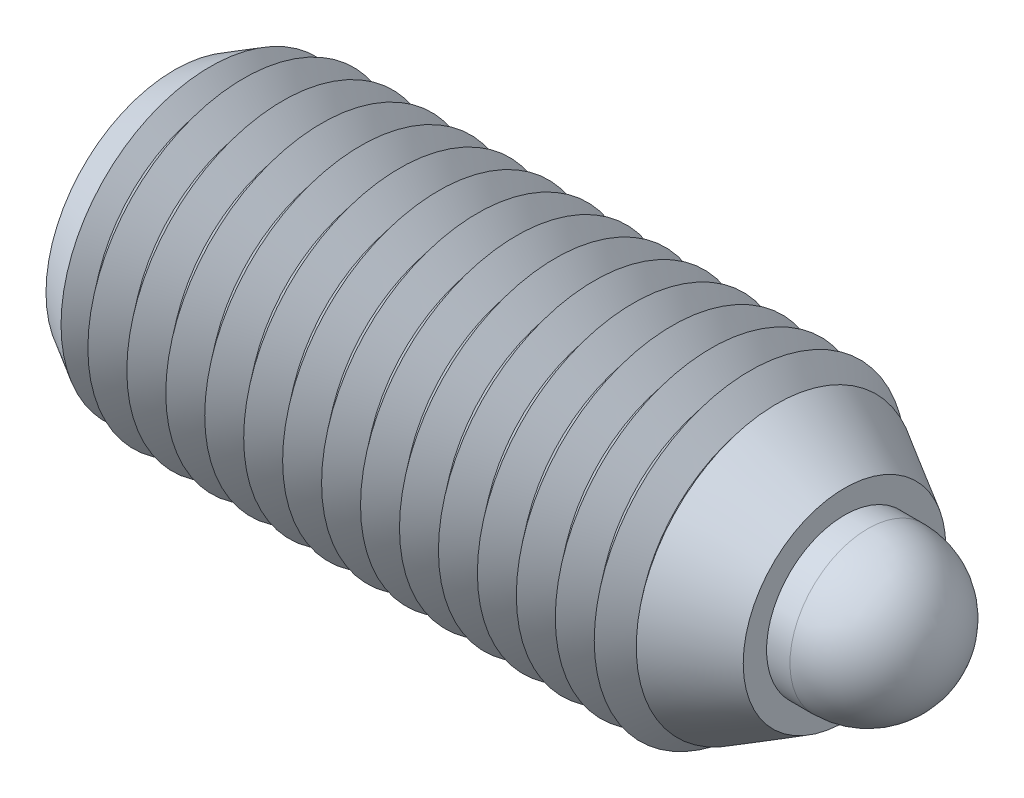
ISO-10303-21;
HEADER;
FILE_DESCRIPTION(('STEP AP214'),'2;1');
FILE_NAME('part.step','',(''),(''),'','','');
FILE_SCHEMA(('AUTOMOTIVE_DESIGN { 1 0 10303 214 1 1 1 1 }'));
ENDSEC;
DATA;
#1=APPLICATION_CONTEXT('core data for automotive mechanical design processes');
#2=APPLICATION_PROTOCOL_DEFINITION('international standard','automotive_design',2000,#1);
#3=PRODUCT_CONTEXT('',#1,'mechanical');
#4=PRODUCT('Part','Part','',(#3));
#5=PRODUCT_RELATED_PRODUCT_CATEGORY('part','',(#4));
#6=PRODUCT_DEFINITION_FORMATION('','',#4);
#7=PRODUCT_DEFINITION_CONTEXT('part definition',#1,'design');
#8=PRODUCT_DEFINITION('design','',#6,#7);
#9=PRODUCT_DEFINITION_SHAPE('','',#8);
#10=(LENGTH_UNIT() NAMED_UNIT(*) SI_UNIT(.MILLI.,.METRE.));
#11=(NAMED_UNIT(*) PLANE_ANGLE_UNIT() SI_UNIT($,.RADIAN.));
#12=(NAMED_UNIT(*) SI_UNIT($,.STERADIAN.) SOLID_ANGLE_UNIT());
#13=UNCERTAINTY_MEASURE_WITH_UNIT(LENGTH_MEASURE(1.E-05),#10,'distance_accuracy_value','');
#14=(GEOMETRIC_REPRESENTATION_CONTEXT(3) GLOBAL_UNCERTAINTY_ASSIGNED_CONTEXT((#13)) GLOBAL_UNIT_ASSIGNED_CONTEXT((#10,
#11,#12)) REPRESENTATION_CONTEXT('',''));
#15=CARTESIAN_POINT('',(0.,0.,0.));
#16=DIRECTION('',(0.,0.,1.));
#17=DIRECTION('',(1.,0.,0.));
#18=AXIS2_PLACEMENT_3D('',#15,#16,#17);
#19=CARTESIAN_POINT('',(39.7,0.,0.));
#20=DIRECTION('',(-1.,0.,0.));
#21=DIRECTION('',(0.,0.,1.));
#22=AXIS2_PLACEMENT_3D('',#19,#20,#21);
#23=CYLINDRICAL_SURFACE('',#22,7.);
#24=CARTESIAN_POINT('',(32.8199999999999,0.,0.));
#25=DIRECTION('',(1.,0.,0.));
#26=DIRECTION('',(0.,0.,-1.));
#27=AXIS2_PLACEMENT_3D('',#24,#25,#26);
#28=CIRCLE('',#27,7.);
#29=CARTESIAN_POINT('',(32.8199999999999,0.,7.));
#30=VERTEX_POINT('',#29);
#31=EDGE_CURVE('P0_E21',#30,#30,#28,.T.);
#32=CARTESIAN_POINT('',(37.7,0.,0.));
#33=DIRECTION('',(1.,0.,0.));
#34=DIRECTION('',(0.,0.,-1.));
#35=AXIS2_PLACEMENT_3D('',#32,#33,#34);
#36=CIRCLE('',#35,7.);
#37=CARTESIAN_POINT('',(37.7,0.,7.));
#38=VERTEX_POINT('',#37);
#39=EDGE_CURVE('P0_E25',#38,#38,#36,.F.);
#40=CARTESIAN_POINT('',(32.8199999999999,0.,7.));
#41=CARTESIAN_POINT('',(32.8708333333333,0.,7.));
#42=CARTESIAN_POINT('',(32.9216666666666,0.,7.));
#43=CARTESIAN_POINT('',(33.0233333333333,0.,7.));
#44=CARTESIAN_POINT('',(33.0741666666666,0.,7.));
#45=CARTESIAN_POINT('',(33.1758333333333,0.,7.));
#46=CARTESIAN_POINT('',(33.2266666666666,0.,7.));
#47=CARTESIAN_POINT('',(33.3283333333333,0.,7.));
#48=CARTESIAN_POINT('',(33.3791666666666,0.,7.));
#49=CARTESIAN_POINT('',(33.4808333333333,0.,7.));
#50=CARTESIAN_POINT('',(33.5316666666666,0.,7.));
#51=CARTESIAN_POINT('',(33.6333333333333,0.,7.));
#52=CARTESIAN_POINT('',(33.6841666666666,0.,7.));
#53=CARTESIAN_POINT('',(33.7858333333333,0.,7.));
#54=CARTESIAN_POINT('',(33.8366666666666,0.,7.));
#55=CARTESIAN_POINT('',(33.9383333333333,0.,7.));
#56=CARTESIAN_POINT('',(33.9891666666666,0.,7.));
#57=CARTESIAN_POINT('',(34.0908333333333,0.,7.));
#58=CARTESIAN_POINT('',(34.1416666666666,0.,7.));
#59=CARTESIAN_POINT('',(34.2433333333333,0.,7.));
#60=CARTESIAN_POINT('',(34.2941666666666,0.,7.));
#61=CARTESIAN_POINT('',(34.3958333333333,0.,7.));
#62=CARTESIAN_POINT('',(34.4466666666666,0.,7.));
#63=CARTESIAN_POINT('',(34.5483333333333,0.,7.));
#64=CARTESIAN_POINT('',(34.5991666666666,0.,7.));
#65=CARTESIAN_POINT('',(34.7008333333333,0.,7.));
#66=CARTESIAN_POINT('',(34.7516666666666,0.,7.));
#67=CARTESIAN_POINT('',(34.8533333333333,0.,7.));
#68=CARTESIAN_POINT('',(34.9041666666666,0.,7.));
#69=CARTESIAN_POINT('',(35.0058333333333,0.,7.));
#70=CARTESIAN_POINT('',(35.0566666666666,0.,7.));
#71=CARTESIAN_POINT('',(35.1583333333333,0.,7.));
#72=CARTESIAN_POINT('',(35.2091666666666,0.,7.));
#73=CARTESIAN_POINT('',(35.3108333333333,0.,7.));
#74=CARTESIAN_POINT('',(35.3616666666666,0.,7.));
#75=CARTESIAN_POINT('',(35.4633333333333,0.,7.));
#76=CARTESIAN_POINT('',(35.5141666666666,0.,7.));
#77=CARTESIAN_POINT('',(35.6158333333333,0.,7.));
#78=CARTESIAN_POINT('',(35.6666666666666,0.,7.));
#79=CARTESIAN_POINT('',(35.7683333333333,0.,7.));
#80=CARTESIAN_POINT('',(35.8191666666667,0.,7.));
#81=CARTESIAN_POINT('',(35.9208333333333,0.,7.));
#82=CARTESIAN_POINT('',(35.9716666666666,0.,7.));
#83=CARTESIAN_POINT('',(36.0733333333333,0.,7.));
#84=CARTESIAN_POINT('',(36.1241666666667,0.,7.));
#85=CARTESIAN_POINT('',(36.2258333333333,0.,7.));
#86=CARTESIAN_POINT('',(36.2766666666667,0.,7.));
#87=CARTESIAN_POINT('',(36.3783333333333,0.,7.));
#88=CARTESIAN_POINT('',(36.4291666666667,0.,7.));
#89=CARTESIAN_POINT('',(36.5308333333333,0.,7.));
#90=CARTESIAN_POINT('',(36.5816666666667,0.,7.));
#91=CARTESIAN_POINT('',(36.6833333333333,0.,7.));
#92=CARTESIAN_POINT('',(36.7341666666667,0.,7.));
#93=CARTESIAN_POINT('',(36.8358333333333,0.,7.));
#94=CARTESIAN_POINT('',(36.8866666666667,0.,7.));
#95=CARTESIAN_POINT('',(36.9883333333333,0.,7.));
#96=CARTESIAN_POINT('',(37.0391666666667,0.,7.));
#97=CARTESIAN_POINT('',(37.1408333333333,0.,7.));
#98=CARTESIAN_POINT('',(37.1916666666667,0.,7.));
#99=CARTESIAN_POINT('',(37.2933333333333,0.,7.));
#100=CARTESIAN_POINT('',(37.3441666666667,0.,7.));
#101=CARTESIAN_POINT('',(37.4458333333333,0.,7.));
#102=CARTESIAN_POINT('',(37.4966666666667,0.,7.));
#103=CARTESIAN_POINT('',(37.5983333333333,0.,7.));
#104=CARTESIAN_POINT('',(37.6491666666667,0.,7.));
#105=CARTESIAN_POINT('',(37.7,0.,7.));
#106=B_SPLINE_CURVE_WITH_KNOTS('',3,(#40,#41,#42,#43,#44,#45,#46,#47,#48,#49,#50,#51,#52,#53,
#54,#55,#56,#57,#58,#59,#60,#61,#62,#63,#64,#65,#66,#67,#68,#69,#70,#71,#72,#73,#74,#75,#76,#77,
#78,#79,#80,#81,#82,#83,#84,#85,#86,#87,#88,#89,#90,#91,#92,#93,#94,#95,#96,#97,#98,#99,#100,
#101,#102,#103,#104,#105),.UNSPECIFIED.,.F.,.F.,(4,2,2,2,2,2,2,2,2,2,2,2,2,2,2,2,2,2,2,2,2,2,2,
2,2,2,2,2,2,2,2,2,4),(0.,0.152500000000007,0.305000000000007,0.457500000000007,
0.610000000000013,0.762500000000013,0.915000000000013,1.06750000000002,1.22000000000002,
1.37250000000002,1.52500000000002,1.67750000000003,1.83000000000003,1.98250000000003,
2.13500000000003,2.28750000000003,2.44000000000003,2.59250000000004,2.74500000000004,
2.89750000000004,3.05000000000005,3.20250000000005,3.35500000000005,3.50750000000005,
3.66000000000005,3.81250000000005,3.96500000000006,4.11750000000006,4.27000000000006,
4.42250000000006,4.57500000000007,4.72750000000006,4.88000000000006),.UNSPECIFIED.);
#107=EDGE_CURVE('P0_BSEAM14',#30,#38,#106,.T.);
#108=ORIENTED_EDGE('',*,*,#31,.T.);
#109=ORIENTED_EDGE('',*,*,#39,.T.);
#110=ORIENTED_EDGE('',*,*,#107,.T.);
#111=ORIENTED_EDGE('',*,*,#107,.F.);
#112=EDGE_LOOP('',(#108,#110,#109,#111));
#113=FACE_BOUND('',#112,.T.);
#114=ADVANCED_FACE('P0_F14',(#113),#23,.T.);
#115=CARTESIAN_POINT('',(31.1,0.,0.));
#116=DIRECTION('',(1.,0.,0.));
#117=DIRECTION('',(0.,0.,-1.));
#118=AXIS2_PLACEMENT_3D('',#115,#116,#117);
#119=PLANE('',#118);
#120=CARTESIAN_POINT('',(31.1,0.,0.));
#121=DIRECTION('',(1.,0.,0.));
#122=DIRECTION('',(0.,0.,-1.));
#123=AXIS2_PLACEMENT_3D('',#120,#121,#122);
#124=CIRCLE('',#123,6.53912738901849);
#125=CARTESIAN_POINT('',(31.1,0.,-6.53912738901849));
#126=VERTEX_POINT('',#125);
#127=EDGE_CURVE('P0_E10',#126,#126,#124,.F.);
#128=ORIENTED_EDGE('',*,*,#127,.T.);
#129=EDGE_LOOP('',(#128));
#130=FACE_BOUND('',#129,.T.);
#131=ADVANCED_FACE('P0_F43',(#130),#119,.F.);
#132=CARTESIAN_POINT('',(44.5,0.,0.));
#133=DIRECTION('',(-1.,0.,0.));
#134=DIRECTION('',(0.,0.,1.));
#135=AXIS2_PLACEMENT_3D('',#132,#133,#134);
#136=CYLINDRICAL_SURFACE('',#135,5.);
#137=CARTESIAN_POINT('',(44.5,0.,0.));
#138=DIRECTION('',(1.,0.,0.));
#139=DIRECTION('',(0.,0.,-1.));
#140=AXIS2_PLACEMENT_3D('',#137,#138,#139);
#141=CIRCLE('',#140,5.);
#142=CARTESIAN_POINT('',(44.5,0.,-5.));
#143=VERTEX_POINT('',#142);
#144=EDGE_CURVE('P0_E29',#143,#143,#141,.T.);
#145=ORIENTED_EDGE('',*,*,#144,.F.);
#146=EDGE_LOOP('',(#145));
#147=FACE_BOUND('',#146,.T.);
#148=CARTESIAN_POINT('',(39.7,0.,0.));
#149=DIRECTION('',(1.,0.,0.));
#150=DIRECTION('',(0.,0.,-1.));
#151=AXIS2_PLACEMENT_3D('',#148,#149,#150);
#152=CIRCLE('',#151,5.);
#153=CARTESIAN_POINT('',(39.7,0.,-5.));
#154=VERTEX_POINT('',#153);
#155=EDGE_CURVE('P0_E32',#154,#154,#152,.T.);
#156=ORIENTED_EDGE('',*,*,#155,.T.);
#157=EDGE_LOOP('',(#156));
#158=FACE_BOUND('',#157,.T.);
#159=ADVANCED_FACE('P0_F40',(#147,#158),#136,.T.);
#160=CARTESIAN_POINT('',(44.5,0.,0.));
#161=DIRECTION('',(-1.,0.,0.));
#162=DIRECTION('',(0.,1.,0.));
#163=AXIS2_PLACEMENT_3D('',#160,#161,#162);
#164=SPHERICAL_SURFACE('',#163,5.);
#165=ORIENTED_EDGE('',*,*,#144,.T.);
#166=EDGE_LOOP('',(#165));
#167=FACE_BOUND('',#166,.T.);
#168=ADVANCED_FACE('P0_F38',(#167),#164,.T.);
#169=CARTESIAN_POINT('',(39.7,0.,0.));
#170=DIRECTION('',(-1.,0.,0.));
#171=DIRECTION('',(0.,0.,1.));
#172=AXIS2_PLACEMENT_3D('',#169,#170,#171);
#173=CONICAL_SURFACE('',#172,5.00000000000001,0.785398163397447);
#174=ORIENTED_EDGE('',*,*,#39,.F.);
#175=EDGE_LOOP('',(#174));
#176=FACE_BOUND('',#175,.T.);
#177=ORIENTED_EDGE('',*,*,#155,.F.);
#178=EDGE_LOOP('',(#177));
#179=FACE_BOUND('',#178,.T.);
#180=ADVANCED_FACE('P0_F47',(#176,#179),#173,.T.);
#181=CARTESIAN_POINT('',(32.8199999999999,0.,0.));
#182=DIRECTION('',(1.,0.,0.));
#183=DIRECTION('',(0.,0.,-1.));
#184=AXIS2_PLACEMENT_3D('',#181,#182,#183);
#185=CONICAL_SURFACE('',#184,7.,0.261799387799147);
#186=ORIENTED_EDGE('',*,*,#127,.F.);
#187=EDGE_LOOP('',(#186));
#188=FACE_BOUND('',#187,.T.);
#189=ORIENTED_EDGE('',*,*,#31,.F.);
#190=EDGE_LOOP('',(#189));
#191=FACE_BOUND('',#190,.T.);
#192=ADVANCED_FACE('P0_F16',(#188,#191),#185,.T.);
#193=CLOSED_SHELL('',(#114,#131,#159,#168,#180,#192));
#194=MANIFOLD_SOLID_BREP('P0_B1',#193);
#195=CARTESIAN_POINT('',(43.,0.,0.));
#196=DIRECTION('',(-1.,0.,0.));
#197=DIRECTION('',(0.,0.,1.));
#198=AXIS2_PLACEMENT_3D('',#195,#196,#197);
#199=CONICAL_SURFACE('',#198,6.5,0.523598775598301);
#200=CARTESIAN_POINT('',(43.,0.,0.));
#201=DIRECTION('',(1.,0.,0.));
#202=DIRECTION('',(0.,0.,-1.));
#203=AXIS2_PLACEMENT_3D('',#200,#201,#202);
#204=CIRCLE('',#203,6.5);
#205=CARTESIAN_POINT('',(43.,0.,-6.5));
#206=VERTEX_POINT('',#205);
#207=EDGE_CURVE('P1_E326',#206,#206,#204,.T.);
#208=ORIENTED_EDGE('',*,*,#207,.F.);
#209=EDGE_LOOP('',(#208));
#210=FACE_BOUND('',#209,.T.);
#211=CARTESIAN_POINT('',(38.647515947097,0.,0.));
#212=DIRECTION('',(1.,0.,0.));
#213=DIRECTION('',(0.,0.,-1.));
#214=AXIS2_PLACEMENT_3D('',#211,#212,#213);
#215=CIRCLE('',#214,9.01290783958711);
#216=CARTESIAN_POINT('',(38.647515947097,0.,-9.01290783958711));
#217=VERTEX_POINT('',#216);
#218=EDGE_CURVE('P1_E330',#217,#217,#215,.T.);
#219=ORIENTED_EDGE('',*,*,#218,.T.);
#220=EDGE_LOOP('',(#219));
#221=FACE_BOUND('',#220,.T.);
#222=ADVANCED_FACE('P1_F15',(#210,#221),#199,.T.);
#223=CARTESIAN_POINT('',(43.,0.,0.));
#224=DIRECTION('',(1.,0.,0.));
#225=DIRECTION('',(0.,0.,-1.));
#226=AXIS2_PLACEMENT_3D('',#223,#224,#225);
#227=PLANE('',#226);
#228=ORIENTED_EDGE('',*,*,#207,.T.);
#229=EDGE_LOOP('',(#228));
#230=FACE_BOUND('',#229,.T.);
#231=CARTESIAN_POINT('',(43.,0.,0.));
#232=DIRECTION('',(1.,0.,0.));
#233=DIRECTION('',(0.,0.,-1.));
#234=AXIS2_PLACEMENT_3D('',#231,#232,#233);
#235=CIRCLE('',#234,5.);
#236=CARTESIAN_POINT('',(43.,0.,-5.));
#237=VERTEX_POINT('',#236);
#238=EDGE_CURVE('P1_E333',#237,#237,#235,.T.);
#239=ORIENTED_EDGE('',*,*,#238,.F.);
#240=EDGE_LOOP('',(#239));
#241=FACE_BOUND('',#240,.T.);
#242=ADVANCED_FACE('P1_F188',(#230,#241),#227,.T.);
#243=CARTESIAN_POINT('',(12.9,0.,0.));
#244=DIRECTION('',(-1.,0.,0.));
#245=DIRECTION('',(0.,0.,1.));
#246=AXIS2_PLACEMENT_3D('',#243,#244,#245);
#247=PLANE('',#246);
#248=CARTESIAN_POINT('',(12.9,0.,0.));
#249=DIRECTION('',(1.,0.,0.));
#250=DIRECTION('',(0.,0.,-1.));
#251=AXIS2_PLACEMENT_3D('',#248,#249,#250);
#252=CIRCLE('',#251,7.);
#253=CARTESIAN_POINT('',(12.9,0.,-7.));
#254=VERTEX_POINT('',#253);
#255=EDGE_CURVE('P1_E428',#254,#254,#252,.T.);
#256=ORIENTED_EDGE('',*,*,#255,.T.);
#257=EDGE_LOOP('',(#256));
#258=FACE_BOUND('',#257,.T.);
#259=ADVANCED_FACE('P1_F194',(#258),#247,.F.);
#260=CARTESIAN_POINT('',(43.,0.,0.));
#261=DIRECTION('',(1.,0.,0.));
#262=DIRECTION('',(0.,0.,-1.));
#263=AXIS2_PLACEMENT_3D('',#260,#261,#262);
#264=CYLINDRICAL_SURFACE('',#263,7.);
#265=ORIENTED_EDGE('',*,*,#255,.F.);
#266=EDGE_LOOP('',(#265));
#267=FACE_BOUND('',#266,.T.);
#268=CARTESIAN_POINT('',(38.7,0.,0.));
#269=DIRECTION('',(1.,0.,0.));
#270=DIRECTION('',(0.,0.,-1.));
#271=AXIS2_PLACEMENT_3D('',#268,#269,#270);
#272=CIRCLE('',#271,7.);
#273=CARTESIAN_POINT('',(38.7,0.,-7.));
#274=VERTEX_POINT('',#273);
#275=EDGE_CURVE('P1_E426',#274,#274,#272,.T.);
#276=ORIENTED_EDGE('',*,*,#275,.T.);
#277=EDGE_LOOP('',(#276));
#278=FACE_BOUND('',#277,.T.);
#279=ADVANCED_FACE('P1_F755',(#267,#278),#264,.F.);
#280=CARTESIAN_POINT('',(43.,0.,0.));
#281=DIRECTION('',(-1.,0.,0.));
#282=DIRECTION('',(0.,0.,1.));
#283=AXIS2_PLACEMENT_3D('',#280,#281,#282);
#284=CONICAL_SURFACE('',#283,5.,0.435353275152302);
#285=ORIENTED_EDGE('',*,*,#275,.F.);
#286=EDGE_LOOP('',(#285));
#287=FACE_BOUND('',#286,.T.);
#288=ORIENTED_EDGE('',*,*,#238,.T.);
#289=EDGE_LOOP('',(#288));
#290=FACE_BOUND('',#289,.T.);
#291=ADVANCED_FACE('P1_F747',(#287,#290),#284,.F.);
#292=CARTESIAN_POINT('',(38.187822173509,0.,0.));
#293=DIRECTION('',(1.,0.,0.));
#294=DIRECTION('',(0.,0.,-1.));
#295=AXIS2_PLACEMENT_3D('',#292,#293,#294);
#296=CONICAL_SURFACE('',#295,8.4387505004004,0.895664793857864);
#297=ORIENTED_EDGE('',*,*,#218,.F.);
#298=EDGE_LOOP('',(#297));
#299=FACE_BOUND('',#298,.T.);
#300=CARTESIAN_POINT('',(38.187822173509,0.,0.));
#301=DIRECTION('',(-1.,0.,0.));
#302=DIRECTION('',(0.,0.,1.));
#303=AXIS2_PLACEMENT_3D('',#300,#301,#302);
#304=CIRCLE('',#303,8.4387505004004);
#305=CARTESIAN_POINT('',(38.187822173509,0.,8.4387505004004));
#306=VERTEX_POINT('',#305);
#307=EDGE_CURVE('P1_E334',#306,#306,#304,.T.);
#308=ORIENTED_EDGE('',*,*,#307,.F.);
#309=EDGE_LOOP('',(#308));
#310=FACE_BOUND('',#309,.T.);
#311=ADVANCED_FACE('P1_F739',(#299,#310),#296,.T.);
#312=CARTESIAN_POINT('',(36.937822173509,0.,0.));
#313=DIRECTION('',(-1.,0.,0.));
#314=DIRECTION('',(0.,0.,1.));
#315=AXIS2_PLACEMENT_3D('',#312,#313,#314);
#316=CONICAL_SURFACE('',#315,10.,0.895664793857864);
#317=ORIENTED_EDGE('',*,*,#307,.T.);
#318=EDGE_LOOP('',(#317));
#319=FACE_BOUND('',#318,.T.);
#320=CARTESIAN_POINT('',(36.937822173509,0.,0.));
#321=DIRECTION('',(-1.,0.,0.));
#322=DIRECTION('',(0.,0.,1.));
#323=AXIS2_PLACEMENT_3D('',#320,#321,#322);
#324=CIRCLE('',#323,10.);
#325=CARTESIAN_POINT('',(36.937822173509,0.,10.));
#326=VERTEX_POINT('',#325);
#327=EDGE_CURVE('P1_E419',#326,#326,#324,.T.);
#328=ORIENTED_EDGE('',*,*,#327,.F.);
#329=EDGE_LOOP('',(#328));
#330=FACE_BOUND('',#329,.T.);
#331=ADVANCED_FACE('P1_F731',(#319,#330),#316,.T.);
#332=CARTESIAN_POINT('',(35.6878221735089,0.,0.));
#333=DIRECTION('',(1.,0.,0.));
#334=DIRECTION('',(0.,0.,-1.));
#335=AXIS2_PLACEMENT_3D('',#332,#333,#334);
#336=CONICAL_SURFACE('',#335,8.4387505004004,0.895664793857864);
#337=ORIENTED_EDGE('',*,*,#327,.T.);
#338=EDGE_LOOP('',(#337));
#339=FACE_BOUND('',#338,.T.);
#340=CARTESIAN_POINT('',(35.6878221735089,0.,0.));
#341=DIRECTION('',(-1.,0.,0.));
#342=DIRECTION('',(0.,0.,1.));
#343=AXIS2_PLACEMENT_3D('',#340,#341,#342);
#344=CIRCLE('',#343,8.4387505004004);
#345=CARTESIAN_POINT('',(35.6878221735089,0.,8.4387505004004));
#346=VERTEX_POINT('',#345);
#347=EDGE_CURVE('P1_E416',#346,#346,#344,.T.);
#348=ORIENTED_EDGE('',*,*,#347,.F.);
#349=EDGE_LOOP('',(#348));
#350=FACE_BOUND('',#349,.T.);
#351=ADVANCED_FACE('P1_F723',(#339,#350),#336,.T.);
#352=CARTESIAN_POINT('',(34.4378221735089,0.,0.));
#353=DIRECTION('',(-1.,0.,0.));
#354=DIRECTION('',(0.,0.,1.));
#355=AXIS2_PLACEMENT_3D('',#352,#353,#354);
#356=CONICAL_SURFACE('',#355,10.,0.895664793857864);
#357=ORIENTED_EDGE('',*,*,#347,.T.);
#358=EDGE_LOOP('',(#357));
#359=FACE_BOUND('',#358,.T.);
#360=CARTESIAN_POINT('',(34.437822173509,0.,0.));
#361=DIRECTION('',(-1.,0.,0.));
#362=DIRECTION('',(0.,0.,1.));
#363=AXIS2_PLACEMENT_3D('',#360,#361,#362);
#364=CIRCLE('',#363,10.);
#365=CARTESIAN_POINT('',(34.437822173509,0.,10.));
#366=VERTEX_POINT('',#365);
#367=EDGE_CURVE('P1_E413',#366,#366,#364,.T.);
#368=ORIENTED_EDGE('',*,*,#367,.F.);
#369=EDGE_LOOP('',(#368));
#370=FACE_BOUND('',#369,.T.);
#371=ADVANCED_FACE('P1_F715',(#359,#370),#356,.T.);
#372=CARTESIAN_POINT('',(33.187822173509,0.,0.));
#373=DIRECTION('',(1.,0.,0.));
#374=DIRECTION('',(0.,0.,-1.));
#375=AXIS2_PLACEMENT_3D('',#372,#373,#374);
#376=CONICAL_SURFACE('',#375,8.4387505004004,0.895664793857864);
#377=ORIENTED_EDGE('',*,*,#367,.T.);
#378=EDGE_LOOP('',(#377));
#379=FACE_BOUND('',#378,.T.);
#380=CARTESIAN_POINT('',(33.187822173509,0.,0.));
#381=DIRECTION('',(-1.,0.,0.));
#382=DIRECTION('',(0.,0.,1.));
#383=AXIS2_PLACEMENT_3D('',#380,#381,#382);
#384=CIRCLE('',#383,8.4387505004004);
#385=CARTESIAN_POINT('',(33.187822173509,0.,8.4387505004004));
#386=VERTEX_POINT('',#385);
#387=EDGE_CURVE('P1_E410',#386,#386,#384,.T.);
#388=ORIENTED_EDGE('',*,*,#387,.F.);
#389=EDGE_LOOP('',(#388));
#390=FACE_BOUND('',#389,.T.);
#391=ADVANCED_FACE('P1_F707',(#379,#390),#376,.T.);
#392=CARTESIAN_POINT('',(31.937822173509,0.,0.));
#393=DIRECTION('',(-1.,0.,0.));
#394=DIRECTION('',(0.,0.,1.));
#395=AXIS2_PLACEMENT_3D('',#392,#393,#394);
#396=CONICAL_SURFACE('',#395,10.,0.895664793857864);
#397=ORIENTED_EDGE('',*,*,#387,.T.);
#398=EDGE_LOOP('',(#397));
#399=FACE_BOUND('',#398,.T.);
#400=CARTESIAN_POINT('',(31.937822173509,0.,0.));
#401=DIRECTION('',(-1.,0.,0.));
#402=DIRECTION('',(0.,0.,1.));
#403=AXIS2_PLACEMENT_3D('',#400,#401,#402);
#404=CIRCLE('',#403,10.);
#405=CARTESIAN_POINT('',(31.937822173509,0.,10.));
#406=VERTEX_POINT('',#405);
#407=EDGE_CURVE('P1_E407',#406,#406,#404,.T.);
#408=ORIENTED_EDGE('',*,*,#407,.F.);
#409=EDGE_LOOP('',(#408));
#410=FACE_BOUND('',#409,.T.);
#411=ADVANCED_FACE('P1_F699',(#399,#410),#396,.T.);
#412=CARTESIAN_POINT('',(30.687822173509,0.,0.));
#413=DIRECTION('',(1.,0.,0.));
#414=DIRECTION('',(0.,0.,-1.));
#415=AXIS2_PLACEMENT_3D('',#412,#413,#414);
#416=CONICAL_SURFACE('',#415,8.4387505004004,0.895664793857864);
#417=ORIENTED_EDGE('',*,*,#407,.T.);
#418=EDGE_LOOP('',(#417));
#419=FACE_BOUND('',#418,.T.);
#420=CARTESIAN_POINT('',(30.687822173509,0.,0.));
#421=DIRECTION('',(-1.,0.,0.));
#422=DIRECTION('',(0.,0.,1.));
#423=AXIS2_PLACEMENT_3D('',#420,#421,#422);
#424=CIRCLE('',#423,8.4387505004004);
#425=CARTESIAN_POINT('',(30.687822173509,0.,8.4387505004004));
#426=VERTEX_POINT('',#425);
#427=EDGE_CURVE('P1_E404',#426,#426,#424,.T.);
#428=ORIENTED_EDGE('',*,*,#427,.F.);
#429=EDGE_LOOP('',(#428));
#430=FACE_BOUND('',#429,.T.);
#431=ADVANCED_FACE('P1_F691',(#419,#430),#416,.T.);
#432=CARTESIAN_POINT('',(29.437822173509,0.,0.));
#433=DIRECTION('',(-1.,0.,0.));
#434=DIRECTION('',(0.,0.,1.));
#435=AXIS2_PLACEMENT_3D('',#432,#433,#434);
#436=CONICAL_SURFACE('',#435,10.,0.895664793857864);
#437=ORIENTED_EDGE('',*,*,#427,.T.);
#438=EDGE_LOOP('',(#437));
#439=FACE_BOUND('',#438,.T.);
#440=CARTESIAN_POINT('',(29.437822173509,0.,0.));
#441=DIRECTION('',(-1.,0.,0.));
#442=DIRECTION('',(0.,0.,1.));
#443=AXIS2_PLACEMENT_3D('',#440,#441,#442);
#444=CIRCLE('',#443,10.);
#445=CARTESIAN_POINT('',(29.437822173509,0.,10.));
#446=VERTEX_POINT('',#445);
#447=EDGE_CURVE('P1_E401',#446,#446,#444,.T.);
#448=ORIENTED_EDGE('',*,*,#447,.F.);
#449=EDGE_LOOP('',(#448));
#450=FACE_BOUND('',#449,.T.);
#451=ADVANCED_FACE('P1_F683',(#439,#450),#436,.T.);
#452=CARTESIAN_POINT('',(28.187822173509,0.,0.));
#453=DIRECTION('',(1.,0.,0.));
#454=DIRECTION('',(0.,0.,-1.));
#455=AXIS2_PLACEMENT_3D('',#452,#453,#454);
#456=CONICAL_SURFACE('',#455,8.4387505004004,0.895664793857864);
#457=ORIENTED_EDGE('',*,*,#447,.T.);
#458=EDGE_LOOP('',(#457));
#459=FACE_BOUND('',#458,.T.);
#460=CARTESIAN_POINT('',(28.187822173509,0.,0.));
#461=DIRECTION('',(-1.,0.,0.));
#462=DIRECTION('',(0.,0.,1.));
#463=AXIS2_PLACEMENT_3D('',#460,#461,#462);
#464=CIRCLE('',#463,8.4387505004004);
#465=CARTESIAN_POINT('',(28.187822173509,0.,8.4387505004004));
#466=VERTEX_POINT('',#465);
#467=EDGE_CURVE('P1_E398',#466,#466,#464,.T.);
#468=ORIENTED_EDGE('',*,*,#467,.F.);
#469=EDGE_LOOP('',(#468));
#470=FACE_BOUND('',#469,.T.);
#471=ADVANCED_FACE('P1_F675',(#459,#470),#456,.T.);
#472=CARTESIAN_POINT('',(26.937822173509,0.,0.));
#473=DIRECTION('',(-1.,0.,0.));
#474=DIRECTION('',(0.,0.,1.));
#475=AXIS2_PLACEMENT_3D('',#472,#473,#474);
#476=CONICAL_SURFACE('',#475,10.,0.895664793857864);
#477=ORIENTED_EDGE('',*,*,#467,.T.);
#478=EDGE_LOOP('',(#477));
#479=FACE_BOUND('',#478,.T.);
#480=CARTESIAN_POINT('',(26.937822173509,0.,0.));
#481=DIRECTION('',(-1.,0.,0.));
#482=DIRECTION('',(0.,0.,1.));
#483=AXIS2_PLACEMENT_3D('',#480,#481,#482);
#484=CIRCLE('',#483,10.);
#485=CARTESIAN_POINT('',(26.937822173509,0.,10.));
#486=VERTEX_POINT('',#485);
#487=EDGE_CURVE('P1_E395',#486,#486,#484,.T.);
#488=ORIENTED_EDGE('',*,*,#487,.F.);
#489=EDGE_LOOP('',(#488));
#490=FACE_BOUND('',#489,.T.);
#491=ADVANCED_FACE('P1_F667',(#479,#490),#476,.T.);
#492=CARTESIAN_POINT('',(25.687822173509,0.,0.));
#493=DIRECTION('',(1.,0.,0.));
#494=DIRECTION('',(0.,0.,-1.));
#495=AXIS2_PLACEMENT_3D('',#492,#493,#494);
#496=CONICAL_SURFACE('',#495,8.4387505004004,0.895664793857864);
#497=ORIENTED_EDGE('',*,*,#487,.T.);
#498=EDGE_LOOP('',(#497));
#499=FACE_BOUND('',#498,.T.);
#500=CARTESIAN_POINT('',(25.687822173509,0.,0.));
#501=DIRECTION('',(-1.,0.,0.));
#502=DIRECTION('',(0.,0.,1.));
#503=AXIS2_PLACEMENT_3D('',#500,#501,#502);
#504=CIRCLE('',#503,8.4387505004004);
#505=CARTESIAN_POINT('',(25.687822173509,0.,8.4387505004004));
#506=VERTEX_POINT('',#505);
#507=EDGE_CURVE('P1_E392',#506,#506,#504,.T.);
#508=ORIENTED_EDGE('',*,*,#507,.F.);
#509=EDGE_LOOP('',(#508));
#510=FACE_BOUND('',#509,.T.);
#511=ADVANCED_FACE('P1_F659',(#499,#510),#496,.T.);
#512=CARTESIAN_POINT('',(24.437822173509,0.,0.));
#513=DIRECTION('',(-1.,0.,0.));
#514=DIRECTION('',(0.,0.,1.));
#515=AXIS2_PLACEMENT_3D('',#512,#513,#514);
#516=CONICAL_SURFACE('',#515,10.,0.895664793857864);
#517=ORIENTED_EDGE('',*,*,#507,.T.);
#518=EDGE_LOOP('',(#517));
#519=FACE_BOUND('',#518,.T.);
#520=CARTESIAN_POINT('',(24.437822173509,0.,0.));
#521=DIRECTION('',(-1.,0.,0.));
#522=DIRECTION('',(0.,0.,1.));
#523=AXIS2_PLACEMENT_3D('',#520,#521,#522);
#524=CIRCLE('',#523,10.);
#525=CARTESIAN_POINT('',(24.437822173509,0.,10.));
#526=VERTEX_POINT('',#525);
#527=EDGE_CURVE('P1_E389',#526,#526,#524,.T.);
#528=ORIENTED_EDGE('',*,*,#527,.F.);
#529=EDGE_LOOP('',(#528));
#530=FACE_BOUND('',#529,.T.);
#531=ADVANCED_FACE('P1_F651',(#519,#530),#516,.T.);
#532=CARTESIAN_POINT('',(23.187822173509,0.,0.));
#533=DIRECTION('',(1.,0.,0.));
#534=DIRECTION('',(0.,0.,-1.));
#535=AXIS2_PLACEMENT_3D('',#532,#533,#534);
#536=CONICAL_SURFACE('',#535,8.4387505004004,0.895664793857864);
#537=ORIENTED_EDGE('',*,*,#527,.T.);
#538=EDGE_LOOP('',(#537));
#539=FACE_BOUND('',#538,.T.);
#540=CARTESIAN_POINT('',(23.187822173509,0.,0.));
#541=DIRECTION('',(-1.,0.,0.));
#542=DIRECTION('',(0.,0.,1.));
#543=AXIS2_PLACEMENT_3D('',#540,#541,#542);
#544=CIRCLE('',#543,8.4387505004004);
#545=CARTESIAN_POINT('',(23.187822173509,0.,8.4387505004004));
#546=VERTEX_POINT('',#545);
#547=EDGE_CURVE('P1_E386',#546,#546,#544,.T.);
#548=ORIENTED_EDGE('',*,*,#547,.F.);
#549=EDGE_LOOP('',(#548));
#550=FACE_BOUND('',#549,.T.);
#551=ADVANCED_FACE('P1_F643',(#539,#550),#536,.T.);
#552=CARTESIAN_POINT('',(21.937822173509,0.,0.));
#553=DIRECTION('',(-1.,0.,0.));
#554=DIRECTION('',(0.,0.,1.));
#555=AXIS2_PLACEMENT_3D('',#552,#553,#554);
#556=CONICAL_SURFACE('',#555,10.,0.895664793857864);
#557=ORIENTED_EDGE('',*,*,#547,.T.);
#558=EDGE_LOOP('',(#557));
#559=FACE_BOUND('',#558,.T.);
#560=CARTESIAN_POINT('',(21.937822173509,0.,0.));
#561=DIRECTION('',(-1.,0.,0.));
#562=DIRECTION('',(0.,0.,1.));
#563=AXIS2_PLACEMENT_3D('',#560,#561,#562);
#564=CIRCLE('',#563,10.);
#565=CARTESIAN_POINT('',(21.937822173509,0.,10.));
#566=VERTEX_POINT('',#565);
#567=EDGE_CURVE('P1_E383',#566,#566,#564,.T.);
#568=ORIENTED_EDGE('',*,*,#567,.F.);
#569=EDGE_LOOP('',(#568));
#570=FACE_BOUND('',#569,.T.);
#571=ADVANCED_FACE('P1_F635',(#559,#570),#556,.T.);
#572=CARTESIAN_POINT('',(20.687822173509,0.,0.));
#573=DIRECTION('',(1.,0.,0.));
#574=DIRECTION('',(0.,0.,-1.));
#575=AXIS2_PLACEMENT_3D('',#572,#573,#574);
#576=CONICAL_SURFACE('',#575,8.4387505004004,0.895664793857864);
#577=ORIENTED_EDGE('',*,*,#567,.T.);
#578=EDGE_LOOP('',(#577));
#579=FACE_BOUND('',#578,.T.);
#580=CARTESIAN_POINT('',(20.687822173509,0.,0.));
#581=DIRECTION('',(-1.,0.,0.));
#582=DIRECTION('',(0.,0.,1.));
#583=AXIS2_PLACEMENT_3D('',#580,#581,#582);
#584=CIRCLE('',#583,8.4387505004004);
#585=CARTESIAN_POINT('',(20.687822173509,0.,8.4387505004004));
#586=VERTEX_POINT('',#585);
#587=EDGE_CURVE('P1_E380',#586,#586,#584,.T.);
#588=ORIENTED_EDGE('',*,*,#587,.F.);
#589=EDGE_LOOP('',(#588));
#590=FACE_BOUND('',#589,.T.);
#591=ADVANCED_FACE('P1_F627',(#579,#590),#576,.T.);
#592=CARTESIAN_POINT('',(19.437822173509,0.,0.));
#593=DIRECTION('',(-1.,0.,0.));
#594=DIRECTION('',(0.,0.,1.));
#595=AXIS2_PLACEMENT_3D('',#592,#593,#594);
#596=CONICAL_SURFACE('',#595,10.,0.895664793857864);
#597=ORIENTED_EDGE('',*,*,#587,.T.);
#598=EDGE_LOOP('',(#597));
#599=FACE_BOUND('',#598,.T.);
#600=CARTESIAN_POINT('',(19.437822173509,0.,0.));
#601=DIRECTION('',(-1.,0.,0.));
#602=DIRECTION('',(0.,0.,1.));
#603=AXIS2_PLACEMENT_3D('',#600,#601,#602);
#604=CIRCLE('',#603,10.);
#605=CARTESIAN_POINT('',(19.437822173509,0.,10.));
#606=VERTEX_POINT('',#605);
#607=EDGE_CURVE('P1_E377',#606,#606,#604,.T.);
#608=ORIENTED_EDGE('',*,*,#607,.F.);
#609=EDGE_LOOP('',(#608));
#610=FACE_BOUND('',#609,.T.);
#611=ADVANCED_FACE('P1_F619',(#599,#610),#596,.T.);
#612=CARTESIAN_POINT('',(18.187822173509,0.,0.));
#613=DIRECTION('',(1.,0.,0.));
#614=DIRECTION('',(0.,0.,-1.));
#615=AXIS2_PLACEMENT_3D('',#612,#613,#614);
#616=CONICAL_SURFACE('',#615,8.4387505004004,0.895664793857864);
#617=ORIENTED_EDGE('',*,*,#607,.T.);
#618=EDGE_LOOP('',(#617));
#619=FACE_BOUND('',#618,.T.);
#620=CARTESIAN_POINT('',(18.187822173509,0.,0.));
#621=DIRECTION('',(-1.,0.,0.));
#622=DIRECTION('',(0.,0.,1.));
#623=AXIS2_PLACEMENT_3D('',#620,#621,#622);
#624=CIRCLE('',#623,8.4387505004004);
#625=CARTESIAN_POINT('',(18.187822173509,0.,8.4387505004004));
#626=VERTEX_POINT('',#625);
#627=EDGE_CURVE('P1_E374',#626,#626,#624,.T.);
#628=ORIENTED_EDGE('',*,*,#627,.F.);
#629=EDGE_LOOP('',(#628));
#630=FACE_BOUND('',#629,.T.);
#631=ADVANCED_FACE('P1_F611',(#619,#630),#616,.T.);
#632=CARTESIAN_POINT('',(16.937822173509,0.,0.));
#633=DIRECTION('',(-1.,0.,0.));
#634=DIRECTION('',(0.,0.,1.));
#635=AXIS2_PLACEMENT_3D('',#632,#633,#634);
#636=CONICAL_SURFACE('',#635,10.,0.895664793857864);
#637=ORIENTED_EDGE('',*,*,#627,.T.);
#638=EDGE_LOOP('',(#637));
#639=FACE_BOUND('',#638,.T.);
#640=CARTESIAN_POINT('',(16.937822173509,0.,0.));
#641=DIRECTION('',(-1.,0.,0.));
#642=DIRECTION('',(0.,0.,1.));
#643=AXIS2_PLACEMENT_3D('',#640,#641,#642);
#644=CIRCLE('',#643,10.);
#645=CARTESIAN_POINT('',(16.937822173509,0.,10.));
#646=VERTEX_POINT('',#645);
#647=EDGE_CURVE('P1_E371',#646,#646,#644,.T.);
#648=ORIENTED_EDGE('',*,*,#647,.F.);
#649=EDGE_LOOP('',(#648));
#650=FACE_BOUND('',#649,.T.);
#651=ADVANCED_FACE('P1_F603',(#639,#650),#636,.T.);
#652=CARTESIAN_POINT('',(15.687822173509,0.,0.));
#653=DIRECTION('',(1.,0.,0.));
#654=DIRECTION('',(0.,0.,-1.));
#655=AXIS2_PLACEMENT_3D('',#652,#653,#654);
#656=CONICAL_SURFACE('',#655,8.4387505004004,0.895664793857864);
#657=ORIENTED_EDGE('',*,*,#647,.T.);
#658=EDGE_LOOP('',(#657));
#659=FACE_BOUND('',#658,.T.);
#660=CARTESIAN_POINT('',(15.687822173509,0.,0.));
#661=DIRECTION('',(-1.,0.,0.));
#662=DIRECTION('',(0.,0.,1.));
#663=AXIS2_PLACEMENT_3D('',#660,#661,#662);
#664=CIRCLE('',#663,8.4387505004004);
#665=CARTESIAN_POINT('',(15.687822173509,0.,8.4387505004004));
#666=VERTEX_POINT('',#665);
#667=EDGE_CURVE('P1_E368',#666,#666,#664,.T.);
#668=ORIENTED_EDGE('',*,*,#667,.F.);
#669=EDGE_LOOP('',(#668));
#670=FACE_BOUND('',#669,.T.);
#671=ADVANCED_FACE('P1_F595',(#659,#670),#656,.T.);
#672=CARTESIAN_POINT('',(14.437822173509,0.,0.));
#673=DIRECTION('',(-1.,0.,0.));
#674=DIRECTION('',(0.,0.,1.));
#675=AXIS2_PLACEMENT_3D('',#672,#673,#674);
#676=CONICAL_SURFACE('',#675,10.,0.895664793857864);
#677=ORIENTED_EDGE('',*,*,#667,.T.);
#678=EDGE_LOOP('',(#677));
#679=FACE_BOUND('',#678,.T.);
#680=CARTESIAN_POINT('',(14.437822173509,0.,0.));
#681=DIRECTION('',(-1.,0.,0.));
#682=DIRECTION('',(0.,0.,1.));
#683=AXIS2_PLACEMENT_3D('',#680,#681,#682);
#684=CIRCLE('',#683,10.);
#685=CARTESIAN_POINT('',(14.437822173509,0.,10.));
#686=VERTEX_POINT('',#685);
#687=EDGE_CURVE('P1_E365',#686,#686,#684,.T.);
#688=ORIENTED_EDGE('',*,*,#687,.F.);
#689=EDGE_LOOP('',(#688));
#690=FACE_BOUND('',#689,.T.);
#691=ADVANCED_FACE('P1_F587',(#679,#690),#676,.T.);
#692=CARTESIAN_POINT('',(13.187822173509,0.,0.));
#693=DIRECTION('',(1.,0.,0.));
#694=DIRECTION('',(0.,0.,-1.));
#695=AXIS2_PLACEMENT_3D('',#692,#693,#694);
#696=CONICAL_SURFACE('',#695,8.4387505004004,0.895664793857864);
#697=ORIENTED_EDGE('',*,*,#687,.T.);
#698=EDGE_LOOP('',(#697));
#699=FACE_BOUND('',#698,.T.);
#700=CARTESIAN_POINT('',(13.187822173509,0.,0.));
#701=DIRECTION('',(-1.,0.,0.));
#702=DIRECTION('',(0.,0.,1.));
#703=AXIS2_PLACEMENT_3D('',#700,#701,#702);
#704=CIRCLE('',#703,8.4387505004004);
#705=CARTESIAN_POINT('',(13.187822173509,0.,8.4387505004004));
#706=VERTEX_POINT('',#705);
#707=EDGE_CURVE('P1_E362',#706,#706,#704,.T.);
#708=ORIENTED_EDGE('',*,*,#707,.F.);
#709=EDGE_LOOP('',(#708));
#710=FACE_BOUND('',#709,.T.);
#711=ADVANCED_FACE('P1_F579',(#699,#710),#696,.T.);
#712=CARTESIAN_POINT('',(11.937822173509,0.,0.));
#713=DIRECTION('',(-1.,0.,0.));
#714=DIRECTION('',(0.,0.,1.));
#715=AXIS2_PLACEMENT_3D('',#712,#713,#714);
#716=CONICAL_SURFACE('',#715,10.,0.895664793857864);
#717=ORIENTED_EDGE('',*,*,#707,.T.);
#718=EDGE_LOOP('',(#717));
#719=FACE_BOUND('',#718,.T.);
#720=CARTESIAN_POINT('',(11.937822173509,0.,0.));
#721=DIRECTION('',(-1.,0.,0.));
#722=DIRECTION('',(0.,0.,1.));
#723=AXIS2_PLACEMENT_3D('',#720,#721,#722);
#724=CIRCLE('',#723,10.);
#725=CARTESIAN_POINT('',(11.937822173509,0.,10.));
#726=VERTEX_POINT('',#725);
#727=EDGE_CURVE('P1_E359',#726,#726,#724,.T.);
#728=ORIENTED_EDGE('',*,*,#727,.F.);
#729=EDGE_LOOP('',(#728));
#730=FACE_BOUND('',#729,.T.);
#731=ADVANCED_FACE('P1_F571',(#719,#730),#716,.T.);
#732=CARTESIAN_POINT('',(10.687822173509,0.,0.));
#733=DIRECTION('',(1.,0.,0.));
#734=DIRECTION('',(0.,0.,-1.));
#735=AXIS2_PLACEMENT_3D('',#732,#733,#734);
#736=CONICAL_SURFACE('',#735,8.4387505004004,0.895664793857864);
#737=ORIENTED_EDGE('',*,*,#727,.T.);
#738=EDGE_LOOP('',(#737));
#739=FACE_BOUND('',#738,.T.);
#740=CARTESIAN_POINT('',(10.687822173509,0.,0.));
#741=DIRECTION('',(-1.,0.,0.));
#742=DIRECTION('',(0.,0.,1.));
#743=AXIS2_PLACEMENT_3D('',#740,#741,#742);
#744=CIRCLE('',#743,8.4387505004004);
#745=CARTESIAN_POINT('',(10.687822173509,0.,8.4387505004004));
#746=VERTEX_POINT('',#745);
#747=EDGE_CURVE('P1_E356',#746,#746,#744,.T.);
#748=ORIENTED_EDGE('',*,*,#747,.F.);
#749=EDGE_LOOP('',(#748));
#750=FACE_BOUND('',#749,.T.);
#751=ADVANCED_FACE('P1_F563',(#739,#750),#736,.T.);
#752=CARTESIAN_POINT('',(9.43782217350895,0.,0.));
#753=DIRECTION('',(-1.,0.,0.));
#754=DIRECTION('',(0.,0.,1.));
#755=AXIS2_PLACEMENT_3D('',#752,#753,#754);
#756=CONICAL_SURFACE('',#755,10.,0.895664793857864);
#757=ORIENTED_EDGE('',*,*,#747,.T.);
#758=EDGE_LOOP('',(#757));
#759=FACE_BOUND('',#758,.T.);
#760=CARTESIAN_POINT('',(9.43782217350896,0.,0.));
#761=DIRECTION('',(-1.,0.,0.));
#762=DIRECTION('',(0.,0.,1.));
#763=AXIS2_PLACEMENT_3D('',#760,#761,#762);
#764=CIRCLE('',#763,10.);
#765=CARTESIAN_POINT('',(9.43782217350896,0.,10.));
#766=VERTEX_POINT('',#765);
#767=EDGE_CURVE('P1_E353',#766,#766,#764,.T.);
#768=ORIENTED_EDGE('',*,*,#767,.F.);
#769=EDGE_LOOP('',(#768));
#770=FACE_BOUND('',#769,.T.);
#771=ADVANCED_FACE('P1_F555',(#759,#770),#756,.T.);
#772=CARTESIAN_POINT('',(8.18782217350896,0.,0.));
#773=DIRECTION('',(1.,0.,0.));
#774=DIRECTION('',(0.,0.,-1.));
#775=AXIS2_PLACEMENT_3D('',#772,#773,#774);
#776=CONICAL_SURFACE('',#775,8.4387505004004,0.895664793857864);
#777=ORIENTED_EDGE('',*,*,#767,.T.);
#778=EDGE_LOOP('',(#777));
#779=FACE_BOUND('',#778,.T.);
#780=CARTESIAN_POINT('',(8.18782217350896,0.,0.));
#781=DIRECTION('',(-1.,0.,0.));
#782=DIRECTION('',(0.,0.,1.));
#783=AXIS2_PLACEMENT_3D('',#780,#781,#782);
#784=CIRCLE('',#783,8.4387505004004);
#785=CARTESIAN_POINT('',(8.18782217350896,0.,8.4387505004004));
#786=VERTEX_POINT('',#785);
#787=EDGE_CURVE('P1_E350',#786,#786,#784,.T.);
#788=ORIENTED_EDGE('',*,*,#787,.F.);
#789=EDGE_LOOP('',(#788));
#790=FACE_BOUND('',#789,.T.);
#791=ADVANCED_FACE('P1_F547',(#779,#790),#776,.T.);
#792=CARTESIAN_POINT('',(6.93782217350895,0.,0.));
#793=DIRECTION('',(-1.,0.,0.));
#794=DIRECTION('',(0.,0.,1.));
#795=AXIS2_PLACEMENT_3D('',#792,#793,#794);
#796=CONICAL_SURFACE('',#795,10.,0.895664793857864);
#797=ORIENTED_EDGE('',*,*,#787,.T.);
#798=EDGE_LOOP('',(#797));
#799=FACE_BOUND('',#798,.T.);
#800=CARTESIAN_POINT('',(6.93782217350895,0.,0.));
#801=DIRECTION('',(-1.,0.,0.));
#802=DIRECTION('',(0.,0.,1.));
#803=AXIS2_PLACEMENT_3D('',#800,#801,#802);
#804=CIRCLE('',#803,10.);
#805=CARTESIAN_POINT('',(6.93782217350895,0.,10.));
#806=VERTEX_POINT('',#805);
#807=EDGE_CURVE('P1_E342',#806,#806,#804,.T.);
#808=ORIENTED_EDGE('',*,*,#807,.F.);
#809=EDGE_LOOP('',(#808));
#810=FACE_BOUND('',#809,.T.);
#811=ADVANCED_FACE('P1_F539',(#799,#810),#796,.T.);
#812=CARTESIAN_POINT('',(5.68782217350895,0.,0.));
#813=DIRECTION('',(1.,0.,0.));
#814=DIRECTION('',(0.,0.,-1.));
#815=AXIS2_PLACEMENT_3D('',#812,#813,#814);
#816=CONICAL_SURFACE('',#815,8.4387505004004,0.895664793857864);
#817=ORIENTED_EDGE('',*,*,#807,.T.);
#818=EDGE_LOOP('',(#817));
#819=FACE_BOUND('',#818,.T.);
#820=CARTESIAN_POINT('',(5.68782217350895,0.,0.));
#821=DIRECTION('',(-1.,0.,0.));
#822=DIRECTION('',(0.,0.,1.));
#823=AXIS2_PLACEMENT_3D('',#820,#821,#822);
#824=CIRCLE('',#823,8.4387505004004);
#825=CARTESIAN_POINT('',(5.68782217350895,0.,8.4387505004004));
#826=VERTEX_POINT('',#825);
#827=EDGE_CURVE('P1_E338',#826,#826,#824,.T.);
#828=ORIENTED_EDGE('',*,*,#827,.F.);
#829=EDGE_LOOP('',(#828));
#830=FACE_BOUND('',#829,.T.);
#831=ADVANCED_FACE('P1_F531',(#819,#830),#816,.T.);
#832=CARTESIAN_POINT('',(4.43782217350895,0.,0.));
#833=DIRECTION('',(-1.,0.,0.));
#834=DIRECTION('',(0.,0.,1.));
#835=AXIS2_PLACEMENT_3D('',#832,#833,#834);
#836=CONICAL_SURFACE('',#835,10.,0.895664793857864);
#837=ORIENTED_EDGE('',*,*,#827,.T.);
#838=EDGE_LOOP('',(#837));
#839=FACE_BOUND('',#838,.T.);
#840=CARTESIAN_POINT('',(4.43782217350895,0.,0.));
#841=DIRECTION('',(-1.,0.,0.));
#842=DIRECTION('',(0.,0.,1.));
#843=AXIS2_PLACEMENT_3D('',#840,#841,#842);
#844=CIRCLE('',#843,10.);
#845=CARTESIAN_POINT('',(4.43782217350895,0.,10.));
#846=VERTEX_POINT('',#845);
#847=EDGE_CURVE('P1_E126',#846,#846,#844,.T.);
#848=ORIENTED_EDGE('',*,*,#847,.F.);
#849=EDGE_LOOP('',(#848));
#850=FACE_BOUND('',#849,.T.);
#851=ADVANCED_FACE('P1_F525',(#839,#850),#836,.T.);
#852=CARTESIAN_POINT('',(3.18782217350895,0.,0.));
#853=DIRECTION('',(1.,0.,0.));
#854=DIRECTION('',(0.,0.,-1.));
#855=AXIS2_PLACEMENT_3D('',#852,#853,#854);
#856=CONICAL_SURFACE('',#855,8.4387505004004,0.895664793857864);
#857=ORIENTED_EDGE('',*,*,#847,.T.);
#858=EDGE_LOOP('',(#857));
#859=FACE_BOUND('',#858,.T.);
#860=CARTESIAN_POINT('',(3.18782217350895,0.,0.));
#861=DIRECTION('',(-1.,0.,0.));
#862=DIRECTION('',(0.,0.,1.));
#863=AXIS2_PLACEMENT_3D('',#860,#861,#862);
#864=CIRCLE('',#863,8.4387505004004);
#865=CARTESIAN_POINT('',(3.18782217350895,0.,8.4387505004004));
#866=VERTEX_POINT('',#865);
#867=EDGE_CURVE('P1_E123',#866,#866,#864,.T.);
#868=ORIENTED_EDGE('',*,*,#867,.F.);
#869=EDGE_LOOP('',(#868));
#870=FACE_BOUND('',#869,.T.);
#871=ADVANCED_FACE('P1_F518',(#859,#870),#856,.T.);
#872=CARTESIAN_POINT('',(1.93782217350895,0.,0.));
#873=DIRECTION('',(-1.,0.,0.));
#874=DIRECTION('',(0.,0.,1.));
#875=AXIS2_PLACEMENT_3D('',#872,#873,#874);
#876=CONICAL_SURFACE('',#875,10.,0.895664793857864);
#877=CARTESIAN_POINT('',(2.28342837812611,0.,0.));
#878=DIRECTION('',(-1.,0.,0.));
#879=DIRECTION('',(0.,0.,1.));
#880=AXIS2_PLACEMENT_3D('',#877,#878,#879);
#881=CIRCLE('',#880,9.56833798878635);
#882=CARTESIAN_POINT('',(2.28342837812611,0.,9.56833798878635));
#883=VERTEX_POINT('',#882);
#884=EDGE_CURVE('P1_E336',#883,#883,#881,.T.);
#885=ORIENTED_EDGE('',*,*,#884,.F.);
#886=EDGE_LOOP('',(#885));
#887=FACE_BOUND('',#886,.T.);
#888=ORIENTED_EDGE('',*,*,#867,.T.);
#889=EDGE_LOOP('',(#888));
#890=FACE_BOUND('',#889,.T.);
#891=ADVANCED_FACE('P1_F145',(#887,#890),#876,.T.);
#892=CARTESIAN_POINT('',(0.,0.,0.));
#893=DIRECTION('',(1.,0.,0.));
#894=DIRECTION('',(0.,0.,-1.));
#895=AXIS2_PLACEMENT_3D('',#892,#893,#894);
#896=PLANE('',#895);
#897=CARTESIAN_POINT('',(0.,0.,0.));
#898=DIRECTION('',(1.,0.,0.));
#899=DIRECTION('',(0.,0.,-1.));
#900=AXIS2_PLACEMENT_3D('',#897,#898,#899);
#901=CIRCLE('',#900,8.25);
#902=CARTESIAN_POINT('',(0.,0.,-8.25));
#903=VERTEX_POINT('',#902);
#904=EDGE_CURVE('P1_E249',#903,#903,#901,.F.);
#905=ORIENTED_EDGE('',*,*,#904,.T.);
#906=EDGE_LOOP('',(#905));
#907=FACE_BOUND('',#906,.T.);
#908=CARTESIAN_POINT('',(0.,0.,0.));
#909=DIRECTION('',(1.,0.,0.));
#910=DIRECTION('',(0.,0.,-1.));
#911=AXIS2_PLACEMENT_3D('',#908,#909,#910);
#912=CIRCLE('',#911,5.77350269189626);
#913=CARTESIAN_POINT('',(0.,-2.88675134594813,-5.));
#914=VERTEX_POINT('',#913);
#915=CARTESIAN_POINT('',(0.,2.88675134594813,-5.));
#916=VERTEX_POINT('',#915);
#917=EDGE_CURVE('P1_E19',#914,#916,#912,.T.);
#918=ORIENTED_EDGE('',*,*,#917,.T.);
#919=CARTESIAN_POINT('',(0.,5.77350269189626,0.));
#920=VERTEX_POINT('',#919);
#921=EDGE_CURVE('P1_E10',#916,#920,#912,.T.);
#922=ORIENTED_EDGE('',*,*,#921,.T.);
#923=CARTESIAN_POINT('',(0.,0.,0.));
#924=DIRECTION('',(-1.,0.,0.));
#925=DIRECTION('',(0.,0.,1.));
#926=AXIS2_PLACEMENT_3D('',#923,#924,#925);
#927=CIRCLE('',#926,5.77350269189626);
#928=CARTESIAN_POINT('',(0.,2.88675134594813,5.));
#929=VERTEX_POINT('',#928);
#930=EDGE_CURVE('P1_E35',#929,#920,#927,.T.);
#931=ORIENTED_EDGE('',*,*,#930,.F.);
#932=CARTESIAN_POINT('',(0.,-2.88675134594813,5.));
#933=VERTEX_POINT('',#932);
#934=EDGE_CURVE('P1_E24',#929,#933,#912,.T.);
#935=ORIENTED_EDGE('',*,*,#934,.T.);
#936=CARTESIAN_POINT('',(0.,-5.77350269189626,0.));
#937=VERTEX_POINT('',#936);
#938=EDGE_CURVE('P1_E250',#933,#937,#912,.T.);
#939=ORIENTED_EDGE('',*,*,#938,.T.);
#940=EDGE_CURVE('P1_E245',#937,#914,#912,.T.);
#941=ORIENTED_EDGE('',*,*,#940,.T.);
#942=EDGE_LOOP('',(#918,#922,#931,#935,#939,#941));
#943=FACE_BOUND('',#942,.T.);
#944=ADVANCED_FACE('P1_F103',(#907,#943),#896,.F.);
#945=CARTESIAN_POINT('',(3.03108891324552,0.,0.));
#946=DIRECTION('',(1.,0.,0.));
#947=DIRECTION('',(0.,0.,-1.));
#948=AXIS2_PLACEMENT_3D('',#945,#946,#947);
#949=CONICAL_SURFACE('',#948,10.,0.523598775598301);
#950=ORIENTED_EDGE('',*,*,#904,.F.);
#951=EDGE_LOOP('',(#950));
#952=FACE_BOUND('',#951,.T.);
#953=ORIENTED_EDGE('',*,*,#884,.T.);
#954=EDGE_LOOP('',(#953));
#955=FACE_BOUND('',#954,.T.);
#956=ADVANCED_FACE('P1_F17',(#952,#955),#949,.T.);
#957=CARTESIAN_POINT('',(0.,0.,0.));
#958=DIRECTION('',(-1.,0.,0.));
#959=DIRECTION('',(0.,0.,1.));
#960=AXIS2_PLACEMENT_3D('',#957,#958,#959);
#961=CONICAL_SURFACE('',#960,5.77350269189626,1.0471975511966);
#962=ORIENTED_EDGE('',*,*,#917,.F.);
#963=CARTESIAN_POINT('',(-1.8591764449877,-7.47572560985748,-5.));
#964=CARTESIAN_POINT('',(-1.75558753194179,-7.2598083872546,-5.));
#965=CARTESIAN_POINT('',(-1.65307457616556,-7.04336516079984,-5.));
#966=CARTESIAN_POINT('',(-1.45081095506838,-6.60914636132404,-5.));
#967=CARTESIAN_POINT('',(-1.35106078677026,-6.39137055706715,-5.));
#968=CARTESIAN_POINT('',(-1.15437585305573,-5.95295758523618,-5.));
#969=CARTESIAN_POINT('',(-1.05746183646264,-5.73231107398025,-5.));
#970=CARTESIAN_POINT('',(-0.867979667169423,-5.28916652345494,-5.));
#971=CARTESIAN_POINT('',(-0.775411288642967,-5.06666858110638,-5.));
#972=CARTESIAN_POINT('',(-0.593420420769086,-4.61360624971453,-5.));
#973=CARTESIAN_POINT('',(-0.504143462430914,-4.38298305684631,-5.));
#974=CARTESIAN_POINT('',(-0.333012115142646,-3.91894712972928,-5.));
#975=CARTESIAN_POINT('',(-0.251158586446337,-3.68553407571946,-5.));
#976=CARTESIAN_POINT('',(-0.0972114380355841,-3.21607584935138,-5.));
#977=CARTESIAN_POINT('',(-0.0250956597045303,-2.98003802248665,-5.));
#978=CARTESIAN_POINT('',(0.106899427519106,-2.50460036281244,-5.));
#979=CARTESIAN_POINT('',(0.166782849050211,-2.26520168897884,-5.));
#980=CARTESIAN_POINT('',(0.271131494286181,-1.78351008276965,-5.));
#981=CARTESIAN_POINT('',(0.315627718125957,-1.54122399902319,-5.));
#982=CARTESIAN_POINT('',(0.386284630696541,-1.05394116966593,-5.));
#983=CARTESIAN_POINT('',(0.412446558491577,-0.808944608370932,-5.));
#984=CARTESIAN_POINT('',(0.444007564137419,-0.320532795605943,-5.));
#985=CARTESIAN_POINT('',(0.449651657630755,-0.0771337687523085,-5.));
#986=CARTESIAN_POINT('',(0.440328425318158,0.409283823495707,-5.));
#987=CARTESIAN_POINT('',(0.42535982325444,0.652302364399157,-5.));
#988=CARTESIAN_POINT('',(0.382601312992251,1.07311516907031,-5.));
#989=CARTESIAN_POINT('',(0.359178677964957,1.25137461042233,-5.));
#990=CARTESIAN_POINT('',(0.302854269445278,1.60640045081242,-5.));
#991=CARTESIAN_POINT('',(0.269950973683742,1.78316660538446,-5.));
#992=CARTESIAN_POINT('',(0.158770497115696,2.31108826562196,-5.));
#993=CARTESIAN_POINT('',(0.0680484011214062,2.65964204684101,-5.));
#994=CARTESIAN_POINT('',(-0.0869317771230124,3.18079255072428,-5.));
#995=CARTESIAN_POINT('',(-0.142456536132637,3.35613694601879,-5.));
#996=CARTESIAN_POINT('',(-0.258676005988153,3.70512051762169,-5.));
#997=CARTESIAN_POINT('',(-0.319370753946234,3.87875968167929,-5.));
#998=CARTESIAN_POINT('',(-0.445006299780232,4.22440219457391,-5.));
#999=CARTESIAN_POINT('',(-0.509945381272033,4.39640617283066,-5.));
#1000=CARTESIAN_POINT('',(-0.643365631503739,4.73902773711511,-5.));
#1001=CARTESIAN_POINT('',(-0.711846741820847,4.90964534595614,-5.));
#1002=CARTESIAN_POINT('',(-0.891042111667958,5.34516780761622,-5.));
#1003=CARTESIAN_POINT('',(-1.00387187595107,5.60920110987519,-5.));
#1004=CARTESIAN_POINT('',(-1.23495894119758,6.1348891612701,-5.));
#1005=CARTESIAN_POINT('',(-1.35321664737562,6.39654373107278,-5.));
#1006=CARTESIAN_POINT('',(-1.59393657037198,6.91798210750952,-5.));
#1007=CARTESIAN_POINT('',(-1.71639978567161,7.1777654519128,-5.));
#1008=CARTESIAN_POINT('',(-1.96459143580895,7.69577048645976,-5.));
#1009=CARTESIAN_POINT('',(-2.09031994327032,7.95399214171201,-5.));
#1010=CARTESIAN_POINT('',(-2.34451232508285,8.46946169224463,-5.));
#1011=CARTESIAN_POINT('',(-2.47297924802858,8.72670808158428,-5.));
#1012=CARTESIAN_POINT('',(-2.73200026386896,9.24014887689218,-5.));
#1013=CARTESIAN_POINT('',(-2.86255437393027,9.4963432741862,-5.));
#1014=CARTESIAN_POINT('',(-3.25670105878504,10.2635488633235,-5.));
#1015=CARTESIAN_POINT('',(-3.5228179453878,10.7732628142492,-5.));
#1016=CARTESIAN_POINT('',(-4.03430587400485,11.7422670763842,-5.));
#1017=CARTESIAN_POINT('',(-4.2792644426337,12.2017760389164,-5.));
#1018=CARTESIAN_POINT('',(-4.77197580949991,13.1193178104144,-5.));
#1019=CARTESIAN_POINT('',(-5.01972872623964,13.5773505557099,-5.));
#1020=CARTESIAN_POINT('',(-5.51669242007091,14.4911137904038,-5.));
#1021=CARTESIAN_POINT('',(-5.76589788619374,14.9468471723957,-5.));
#1022=CARTESIAN_POINT('',(-6.26592944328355,15.857390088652,-5.));
#1023=CARTESIAN_POINT('',(-6.51675543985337,16.3121996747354,-5.));
#1024=CARTESIAN_POINT('',(-6.76817640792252,16.7666781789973,-5.));
#1025=B_SPLINE_CURVE_WITH_KNOTS('',3,(#963,#964,#965,#966,#967,#968,#969,#970,#971,#972,#973,
#974,#975,#976,#977,#978,#979,#980,#981,#982,#983,#984,#985,#986,#987,#988,#989,#990,#991,#992,
#993,#994,#995,#996,#997,#998,#999,#1000,#1001,#1002,#1003,#1004,#1005,#1006,#1007,#1008,#1009,
#1010,#1011,#1012,#1013,#1014,#1015,#1016,#1017,#1018,#1019,#1020,#1021,#1022,#1023,#1024),
.UNSPECIFIED.,.F.,.F.,(4,2,2,2,2,2,2,2,2,2,2,2,2,2,2,2,2,2,2,2,2,2,2,2,2,2,2,2,2,2,4),(0.,
0.718451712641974,1.4370318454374,2.15997091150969,2.8828723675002,3.62467458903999,
4.3665626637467,5.10673302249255,5.84665411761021,6.58507570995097,7.32344739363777,
8.05297223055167,8.78254223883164,9.32165077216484,9.86084591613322,10.9399123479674,
11.4916504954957,12.0433926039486,12.5949129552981,13.1464242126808,14.0077287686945,
14.8690977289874,15.7306726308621,16.5922667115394,17.454876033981,18.3174924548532,
20.0424560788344,21.6046171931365,23.1668448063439,24.7250988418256,26.2832629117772),.UNSPECIFIED.);
#1026=EDGE_CURVE('P1_E93',#916,#914,#1025,.F.);
#1027=ORIENTED_EDGE('',*,*,#1026,.F.);
#1028=EDGE_LOOP('',(#962,#1027));
#1029=FACE_BOUND('',#1028,.T.);
#1030=ADVANCED_FACE('P1_F248',(#1029),#961,.F.);
#1031=ORIENTED_EDGE('',*,*,#940,.F.);
#1032=CARTESIAN_POINT('',(-6.66686666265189E-05,-2.88663587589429,-5.0002));
#1033=CARTESIAN_POINT('',(0.0731954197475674,-3.01349970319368,-4.78046540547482));
#1034=CARTESIAN_POINT('',(0.139830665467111,-3.14144859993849,-4.55885141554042));
#1035=CARTESIAN_POINT('',(0.256142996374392,-3.39956193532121,-4.11178600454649));
#1036=CARTESIAN_POINT('',(0.305778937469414,-3.52973095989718,-3.88632664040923));
#1037=CARTESIAN_POINT('',(0.383030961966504,-3.78847564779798,-3.43816769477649));
#1038=CARTESIAN_POINT('',(0.411161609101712,-3.91701101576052,-3.21553790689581));
#1039=CARTESIAN_POINT('',(0.436387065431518,-4.11026620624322,-2.88081009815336));
#1040=CARTESIAN_POINT('',(0.441968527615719,-4.17472868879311,-2.76915780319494));
#1041=CARTESIAN_POINT('',(0.447379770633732,-4.30371322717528,-2.5457500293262));
#1042=CARTESIAN_POINT('',(0.447209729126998,-4.36823528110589,-2.43399455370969));
#1043=CARTESIAN_POINT('',(0.438828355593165,-4.54500768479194,-2.12781576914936));
#1044=CARTESIAN_POINT('',(0.42475221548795,-4.65719946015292,-1.93349391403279));
#1045=CARTESIAN_POINT('',(0.380116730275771,-4.88083840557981,-1.54613989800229));
#1046=CARTESIAN_POINT('',(0.349542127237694,-4.9922847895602,-1.35310909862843));
#1047=CARTESIAN_POINT('',(0.273113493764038,-5.21637431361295,-0.964974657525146));
#1048=CARTESIAN_POINT('',(0.226935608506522,-5.32898917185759,-0.769920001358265));
#1049=CARTESIAN_POINT('',(0.122130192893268,-5.55253939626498,-0.382719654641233));
#1050=CARTESIAN_POINT('',(0.0635272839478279,-5.66347762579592,-0.190569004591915));
#1051=CARTESIAN_POINT('',(-6.66686666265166E-05,-5.7736181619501,0.000199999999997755));
#1052=B_SPLINE_CURVE_WITH_KNOTS('',3,(#1032,#1033,#1034,#1035,#1036,#1037,#1038,#1039,#1040,
#1041,#1042,#1043,#1044,#1045,#1046,#1047,#1048,#1049,#1050,#1051),.UNSPECIFIED.,.F.,.F.,(4,2,2,
2,2,2,2,2,2,4),(0.,0.792555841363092,1.58701660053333,2.36181537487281,2.74884076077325,
3.13585419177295,3.80962362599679,4.48401723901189,5.17336882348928,5.86136694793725),.UNSPECIFIED.);
#1053=EDGE_CURVE('P1_E163',#914,#937,#1052,.T.);
#1054=ORIENTED_EDGE('',*,*,#1053,.F.);
#1055=EDGE_LOOP('',(#1031,#1054));
#1056=FACE_BOUND('',#1055,.T.);
#1057=ADVANCED_FACE('P1_F244',(#1056),#961,.F.);
#1058=ORIENTED_EDGE('',*,*,#938,.F.);
#1059=CARTESIAN_POINT('',(-6.66686666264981E-05,-5.7736181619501,-0.000200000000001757));
#1060=CARTESIAN_POINT('',(0.0731954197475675,-5.64675433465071,0.219534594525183));
#1061=CARTESIAN_POINT('',(0.13983066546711,-5.5188054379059,0.441148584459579));
#1062=CARTESIAN_POINT('',(0.256142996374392,-5.26069210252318,0.888213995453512));
#1063=CARTESIAN_POINT('',(0.305778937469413,-5.13052307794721,1.11367335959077));
#1064=CARTESIAN_POINT('',(0.383030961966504,-4.87177839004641,1.56183230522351));
#1065=CARTESIAN_POINT('',(0.411161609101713,-4.74324302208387,1.78446209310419));
#1066=CARTESIAN_POINT('',(0.436387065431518,-4.54998783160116,2.11918990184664));
#1067=CARTESIAN_POINT('',(0.441968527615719,-4.48552534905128,2.23084219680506));
#1068=CARTESIAN_POINT('',(0.447379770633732,-4.35654081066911,2.4542499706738));
#1069=CARTESIAN_POINT('',(0.447209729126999,-4.2920187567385,2.56600544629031));
#1070=CARTESIAN_POINT('',(0.438828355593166,-4.11524635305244,2.87218423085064));
#1071=CARTESIAN_POINT('',(0.424752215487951,-4.00305457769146,3.06650608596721));
#1072=CARTESIAN_POINT('',(0.380116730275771,-3.77941563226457,3.45386010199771));
#1073=CARTESIAN_POINT('',(0.349542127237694,-3.66796924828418,3.64689090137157));
#1074=CARTESIAN_POINT('',(0.273113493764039,-3.44387972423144,4.03502534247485));
#1075=CARTESIAN_POINT('',(0.226935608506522,-3.3312648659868,4.23007999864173));
#1076=CARTESIAN_POINT('',(0.122130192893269,-3.1077146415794,4.61728034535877));
#1077=CARTESIAN_POINT('',(0.0635272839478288,-2.99677641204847,4.80943099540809));
#1078=CARTESIAN_POINT('',(-6.66686666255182E-05,-2.88663587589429,5.0002));
#1079=B_SPLINE_CURVE_WITH_KNOTS('',3,(#1059,#1060,#1061,#1062,#1063,#1064,#1065,#1066,#1067,
#1068,#1069,#1070,#1071,#1072,#1073,#1074,#1075,#1076,#1077,#1078),.UNSPECIFIED.,.F.,.F.,(4,2,2,
2,2,2,2,2,2,4),(0.,0.792555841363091,1.58701660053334,2.36181537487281,2.74884076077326,
3.13585419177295,3.80962362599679,4.48401723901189,5.17336882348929,5.86136694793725),.UNSPECIFIED.);
#1080=EDGE_CURVE('P1_E156',#937,#933,#1079,.T.);
#1081=ORIENTED_EDGE('',*,*,#1080,.F.);
#1082=EDGE_LOOP('',(#1058,#1081));
#1083=FACE_BOUND('',#1082,.T.);
#1084=ADVANCED_FACE('P1_F252',(#1083),#961,.F.);
#1085=ORIENTED_EDGE('',*,*,#934,.F.);
#1086=CARTESIAN_POINT('',(-1.85917644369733,-7.47572560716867,5.));
#1087=CARTESIAN_POINT('',(-1.75558753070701,-7.25980838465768,5.));
#1088=CARTESIAN_POINT('',(-1.65307457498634,-7.04336515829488,5.));
#1089=CARTESIAN_POINT('',(-1.45081095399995,-6.60914635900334,5.));
#1090=CARTESIAN_POINT('',(-1.35106078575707,-6.39137055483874,5.));
#1091=CARTESIAN_POINT('',(-1.1543758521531,-5.95295758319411,5.));
#1092=CARTESIAN_POINT('',(-1.05746183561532,-5.73231107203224,5.));
#1093=CARTESIAN_POINT('',(-0.867979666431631,-5.28916652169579,5.));
#1094=CARTESIAN_POINT('',(-0.7754112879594,-5.06666857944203,5.));
#1095=CARTESIAN_POINT('',(-0.593420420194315,-4.61360624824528,5.));
#1096=CARTESIAN_POINT('',(-0.504143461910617,-4.38298305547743,5.));
#1097=CARTESIAN_POINT('',(-0.333012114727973,-3.91894712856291,5.));
#1098=CARTESIAN_POINT('',(-0.251158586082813,-3.68553407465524,5.));
#1099=CARTESIAN_POINT('',(-0.097211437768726,-3.21607584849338,5.));
#1100=CARTESIAN_POINT('',(-0.0250956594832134,-2.98003802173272,5.));
#1101=CARTESIAN_POINT('',(0.106899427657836,-2.50460036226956,5.));
#1102=CARTESIAN_POINT('',(0.16678284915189,-2.26520168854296,5.));
#1103=CARTESIAN_POINT('',(0.271131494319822,-1.783510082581,5.));
#1104=CARTESIAN_POINT('',(0.315627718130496,-1.5412239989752,5.));
#1105=CARTESIAN_POINT('',(0.386284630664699,-1.0539411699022,5.));
#1106=CARTESIAN_POINT('',(0.412446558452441,-0.808944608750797,5.));
#1107=CARTESIAN_POINT('',(0.444007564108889,-0.320532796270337,5.));
#1108=CARTESIAN_POINT('',(0.449651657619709,-0.0771337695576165,5.));
#1109=CARTESIAN_POINT('',(0.440328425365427,0.409283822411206,5.));
#1110=CARTESIAN_POINT('',(0.425359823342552,0.65230236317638,5.));
#1111=CARTESIAN_POINT('',(0.382601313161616,1.07311516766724,5.));
#1112=CARTESIAN_POINT('',(0.359178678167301,1.25137460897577,5.));
#1113=CARTESIAN_POINT('',(0.302854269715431,1.60640044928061,5.));
#1114=CARTESIAN_POINT('',(0.269950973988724,1.78316660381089,5.));
#1115=CARTESIAN_POINT('',(0.158770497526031,2.31108826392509,5.));
#1116=CARTESIAN_POINT('',(0.068048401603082,2.65964204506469,5.));
#1117=CARTESIAN_POINT('',(-0.0869317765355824,3.1807925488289,5.));
#1118=CARTESIAN_POINT('',(-0.142456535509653,3.35613694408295,5.));
#1119=CARTESIAN_POINT('',(-0.258676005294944,3.70512051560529,5.));
#1120=CARTESIAN_POINT('',(-0.319370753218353,3.87875967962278,5.));
#1121=CARTESIAN_POINT('',(-0.445006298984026,4.22440219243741,5.));
#1122=CARTESIAN_POINT('',(-0.509945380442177,4.39640617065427,5.));
#1123=CARTESIAN_POINT('',(-0.643365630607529,4.73902773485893,5.));
#1124=CARTESIAN_POINT('',(-0.711846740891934,4.90964534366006,5.));
#1125=CARTESIAN_POINT('',(-0.891042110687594,5.34516780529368,5.));
#1126=CARTESIAN_POINT('',(-1.00387187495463,5.60920110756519,5.));
#1127=CARTESIAN_POINT('',(-1.23495894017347,6.13488915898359,5.));
#1128=CARTESIAN_POINT('',(-1.3532166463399,6.39654372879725,5.));
#1129=CARTESIAN_POINT('',(-1.59393656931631,6.91798210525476,5.));
#1130=CARTESIAN_POINT('',(-1.71639978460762,7.17776544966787,5.));
#1131=CARTESIAN_POINT('',(-1.96459143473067,7.69577048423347,5.));
#1132=CARTESIAN_POINT('',(-2.09031994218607,7.95399213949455,5.));
#1133=CARTESIAN_POINT('',(-2.34451232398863,8.46946169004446,5.));
#1134=CARTESIAN_POINT('',(-2.47297924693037,8.72670807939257,5.));
#1135=CARTESIAN_POINT('',(-2.73200026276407,9.24014887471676,5.));
#1136=CARTESIAN_POINT('',(-2.86255437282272,9.49634327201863,5.));
#1137=CARTESIAN_POINT('',(-3.25670105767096,10.2635488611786,5.));
#1138=CARTESIAN_POINT('',(-3.52281794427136,10.7732628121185,5.));
#1139=CARTESIAN_POINT('',(-4.03430587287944,11.7422670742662,5.));
#1140=CARTESIAN_POINT('',(-4.27926444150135,12.2017760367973,5.));
#1141=CARTESIAN_POINT('',(-4.77197580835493,13.1193178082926,5.));
#1142=CARTESIAN_POINT('',(-5.01972872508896,13.5773505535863,5.));
#1143=CARTESIAN_POINT('',(-5.51669241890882,14.4911137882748,5.));
#1144=CARTESIAN_POINT('',(-5.76589788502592,14.9468471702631,5.));
#1145=CARTESIAN_POINT('',(-6.26592944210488,15.8573900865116,5.));
#1146=CARTESIAN_POINT('',(-6.51675543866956,16.3121996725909,5.));
#1147=CARTESIAN_POINT('',(-6.76817640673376,16.7666781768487,5.));
#1148=B_SPLINE_CURVE_WITH_KNOTS('',3,(#1086,#1087,#1088,#1089,#1090,#1091,#1092,#1093,#1094,
#1095,#1096,#1097,#1098,#1099,#1100,#1101,#1102,#1103,#1104,#1105,#1106,#1107,#1108,#1109,#1110,
#1111,#1112,#1113,#1114,#1115,#1116,#1117,#1118,#1119,#1120,#1121,#1122,#1123,#1124,#1125,#1126,
#1127,#1128,#1129,#1130,#1131,#1132,#1133,#1134,#1135,#1136,#1137,#1138,#1139,#1140,#1141,#1142,
#1143,#1144,#1145,#1146,#1147),.UNSPECIFIED.,.F.,.F.,(4,2,2,2,2,2,2,2,2,2,2,2,2,2,2,2,2,2,2,2,2,
2,2,2,2,2,2,2,2,2,4),(0.,0.718451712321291,1.43703184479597,2.15997091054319,2.88287236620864,
3.62467458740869,4.36656266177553,5.10673302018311,5.84665411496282,6.58507570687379,
7.32344739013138,8.05297222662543,8.78254223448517,9.32165076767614,9.86084591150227,
10.9399123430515,11.4916504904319,12.0433925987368,12.5949129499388,13.1464242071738,
14.007728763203,14.8690977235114,15.7306726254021,16.5922667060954,17.4548760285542,
18.3174924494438,20.0424560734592,21.6046171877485,23.1668448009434,24.7250988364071,
26.2832629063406),.UNSPECIFIED.);
#1149=EDGE_CURVE('P1_E100',#933,#929,#1148,.T.);
#1150=ORIENTED_EDGE('',*,*,#1149,.F.);
#1151=EDGE_LOOP('',(#1085,#1150));
#1152=FACE_BOUND('',#1151,.T.);
#1153=ADVANCED_FACE('P1_F144',(#1152),#961,.F.);
#1154=ORIENTED_EDGE('',*,*,#930,.T.);
#1155=CARTESIAN_POINT('',(-6.6668666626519E-05,2.88663587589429,5.0002));
#1156=CARTESIAN_POINT('',(0.0731954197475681,3.01349970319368,4.78046540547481));
#1157=CARTESIAN_POINT('',(0.139830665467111,3.14144859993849,4.55885141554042));
#1158=CARTESIAN_POINT('',(0.256142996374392,3.39956193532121,4.11178600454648));
#1159=CARTESIAN_POINT('',(0.305778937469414,3.52973095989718,3.88632664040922));
#1160=CARTESIAN_POINT('',(0.383030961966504,3.78847564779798,3.43816769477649));
#1161=CARTESIAN_POINT('',(0.411161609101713,3.91701101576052,3.2155379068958));
#1162=CARTESIAN_POINT('',(0.436387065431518,4.11026620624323,2.88081009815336));
#1163=CARTESIAN_POINT('',(0.441968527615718,4.17472868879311,2.76915780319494));
#1164=CARTESIAN_POINT('',(0.447379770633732,4.30371322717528,2.5457500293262));
#1165=CARTESIAN_POINT('',(0.447209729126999,4.36823528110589,2.43399455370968));
#1166=CARTESIAN_POINT('',(0.438828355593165,4.54500768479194,2.12781576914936));
#1167=CARTESIAN_POINT('',(0.42475221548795,4.65719946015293,1.93349391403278));
#1168=CARTESIAN_POINT('',(0.380116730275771,4.88083840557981,1.54613989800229));
#1169=CARTESIAN_POINT('',(0.349542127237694,4.9922847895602,1.35310909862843));
#1170=CARTESIAN_POINT('',(0.273113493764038,5.21637431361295,0.964974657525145));
#1171=CARTESIAN_POINT('',(0.226935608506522,5.32898917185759,0.769920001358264));
#1172=CARTESIAN_POINT('',(0.122130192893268,5.55253939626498,0.382719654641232));
#1173=CARTESIAN_POINT('',(0.0635272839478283,5.66347762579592,0.190569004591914));
#1174=CARTESIAN_POINT('',(-6.6668666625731E-05,5.77361816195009,-0.00019999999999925));
#1175=B_SPLINE_CURVE_WITH_KNOTS('',3,(#1155,#1156,#1157,#1158,#1159,#1160,#1161,#1162,#1163,
#1164,#1165,#1166,#1167,#1168,#1169,#1170,#1171,#1172,#1173,#1174),.UNSPECIFIED.,.F.,.F.,(4,2,2,
2,2,2,2,2,2,4),(0.,0.792555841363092,1.58701660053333,2.36181537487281,2.74884076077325,
3.13585419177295,3.80962362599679,4.48401723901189,5.17336882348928,5.86136694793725),.UNSPECIFIED.);
#1176=EDGE_CURVE('P1_E92',#929,#920,#1175,.T.);
#1177=ORIENTED_EDGE('',*,*,#1176,.F.);
#1178=EDGE_LOOP('',(#1154,#1177));
#1179=FACE_BOUND('',#1178,.T.);
#1180=ADVANCED_FACE('P1_F97',(#1179),#961,.F.);
#1181=ORIENTED_EDGE('',*,*,#921,.F.);
#1182=CARTESIAN_POINT('',(-6.66686666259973E-05,5.7736181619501,0.0002000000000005));
#1183=CARTESIAN_POINT('',(0.0731954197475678,5.64675433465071,-0.219534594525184));
#1184=CARTESIAN_POINT('',(0.139830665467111,5.5188054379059,-0.44114858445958));
#1185=CARTESIAN_POINT('',(0.256142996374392,5.26069210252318,-0.888213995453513));
#1186=CARTESIAN_POINT('',(0.305778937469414,5.13052307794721,-1.11367335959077));
#1187=CARTESIAN_POINT('',(0.383030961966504,4.87177839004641,-1.56183230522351));
#1188=CARTESIAN_POINT('',(0.411161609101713,4.74324302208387,-1.78446209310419));
#1189=CARTESIAN_POINT('',(0.436387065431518,4.54998783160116,-2.11918990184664));
#1190=CARTESIAN_POINT('',(0.441968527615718,4.48552534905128,-2.23084219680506));
#1191=CARTESIAN_POINT('',(0.447379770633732,4.35654081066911,-2.4542499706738));
#1192=CARTESIAN_POINT('',(0.447209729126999,4.2920187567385,-2.56600544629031));
#1193=CARTESIAN_POINT('',(0.438828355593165,4.11524635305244,-2.87218423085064));
#1194=CARTESIAN_POINT('',(0.424752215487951,4.00305457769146,-3.06650608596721));
#1195=CARTESIAN_POINT('',(0.380116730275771,3.77941563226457,-3.45386010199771));
#1196=CARTESIAN_POINT('',(0.349542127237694,3.66796924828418,-3.64689090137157));
#1197=CARTESIAN_POINT('',(0.273113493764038,3.44387972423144,-4.03502534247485));
#1198=CARTESIAN_POINT('',(0.226935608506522,3.3312648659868,-4.23007999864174));
#1199=CARTESIAN_POINT('',(0.122130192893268,3.1077146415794,-4.61728034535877));
#1200=CARTESIAN_POINT('',(0.0635272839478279,2.99677641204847,-4.80943099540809));
#1201=CARTESIAN_POINT('',(-6.66686666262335E-05,2.88663587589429,-5.0002));
#1202=B_SPLINE_CURVE_WITH_KNOTS('',3,(#1182,#1183,#1184,#1185,#1186,#1187,#1188,#1189,#1190,
#1191,#1192,#1193,#1194,#1195,#1196,#1197,#1198,#1199,#1200,#1201),.UNSPECIFIED.,.F.,.F.,(4,2,2,
2,2,2,2,2,2,4),(0.,0.792555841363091,1.58701660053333,2.36181537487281,2.74884076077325,
3.13585419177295,3.80962362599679,4.48401723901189,5.17336882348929,5.86136694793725),.UNSPECIFIED.);
#1203=EDGE_CURVE('P1_E87',#920,#916,#1202,.T.);
#1204=ORIENTED_EDGE('',*,*,#1203,.F.);
#1205=EDGE_LOOP('',(#1181,#1204));
#1206=FACE_BOUND('',#1205,.T.);
#1207=ADVANCED_FACE('P1_F88',(#1206),#961,.F.);
#1208=CARTESIAN_POINT('',(7.74,0.,0.));
#1209=DIRECTION('',(-1.,0.,0.));
#1210=DIRECTION('',(0.,0.,1.));
#1211=AXIS2_PLACEMENT_3D('',#1208,#1209,#1210);
#1212=CONICAL_SURFACE('',#1211,5.,1.0471975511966);
#1213=CARTESIAN_POINT('',(10.6267513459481,0.,0.));
#1214=VERTEX_POINT('',#1213);
#1215=VERTEX_LOOP('',#1214);
#1216=FACE_BOUND('',#1215,.T.);
#1217=CARTESIAN_POINT('',(7.74,0.,0.));
#1218=DIRECTION('',(-1.,0.,0.));
#1219=DIRECTION('',(0.,0.,1.));
#1220=AXIS2_PLACEMENT_3D('',#1217,#1218,#1219);
#1221=CIRCLE('',#1220,5.);
#1222=CARTESIAN_POINT('',(7.74,0.,5.));
#1223=VERTEX_POINT('',#1222);
#1224=CARTESIAN_POINT('',(7.74,4.3301270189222,2.5));
#1225=VERTEX_POINT('',#1224);
#1226=EDGE_CURVE('P1_E300',#1223,#1225,#1221,.T.);
#1227=ORIENTED_EDGE('',*,*,#1226,.T.);
#1228=CARTESIAN_POINT('',(7.74,4.3301270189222,-2.5));
#1229=VERTEX_POINT('',#1228);
#1230=EDGE_CURVE('P1_E329',#1225,#1229,#1221,.T.);
#1231=ORIENTED_EDGE('',*,*,#1230,.T.);
#1232=CARTESIAN_POINT('',(7.74,0.,-5.));
#1233=VERTEX_POINT('',#1232);
#1234=EDGE_CURVE('P1_E433',#1229,#1233,#1221,.T.);
#1235=ORIENTED_EDGE('',*,*,#1234,.T.);
#1236=CARTESIAN_POINT('',(7.74,-4.33012701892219,-2.5));
#1237=VERTEX_POINT('',#1236);
#1238=EDGE_CURVE('P1_E435',#1233,#1237,#1221,.T.);
#1239=ORIENTED_EDGE('',*,*,#1238,.T.);
#1240=CARTESIAN_POINT('',(7.74,-4.33012701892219,2.5));
#1241=VERTEX_POINT('',#1240);
#1242=EDGE_CURVE('P1_E298',#1237,#1241,#1221,.T.);
#1243=ORIENTED_EDGE('',*,*,#1242,.T.);
#1244=EDGE_CURVE('P1_E295',#1241,#1223,#1221,.T.);
#1245=ORIENTED_EDGE('',*,*,#1244,.T.);
#1246=EDGE_LOOP('',(#1227,#1231,#1235,#1239,#1243,#1245));
#1247=FACE_BOUND('',#1246,.T.);
#1248=ADVANCED_FACE('P1_F269',(#1216,#1247),#1212,.F.);
#1249=CARTESIAN_POINT('',(7.74,-2.88675134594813,5.));
#1250=DIRECTION('',(-1.,0.,0.));
#1251=DIRECTION('',(0.,0.,1.));
#1252=AXIS2_PLACEMENT_3D('',#1249,#1250,#1251);
#1253=PLANE('',#1252);
#1254=ORIENTED_EDGE('',*,*,#1230,.F.);
#1255=DIRECTION('',(0.,0.5,-0.866025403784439));
#1256=VECTOR('',#1255,1.);
#1257=CARTESIAN_POINT('',(7.74,2.88675134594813,5.));
#1258=LINE('',#1257,#1256);
#1259=CARTESIAN_POINT('',(7.74,5.77350269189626,0.));
#1260=VERTEX_POINT('',#1259);
#1261=EDGE_CURVE('P1_E310',#1225,#1260,#1258,.T.);
#1262=ORIENTED_EDGE('',*,*,#1261,.T.);
#1263=DIRECTION('',(0.,-0.5,-0.866025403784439));
#1264=VECTOR('',#1263,1.);
#1265=CARTESIAN_POINT('',(7.74,5.77350269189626,0.));
#1266=LINE('',#1265,#1264);
#1267=EDGE_CURVE('P1_E113',#1260,#1229,#1266,.T.);
#1268=ORIENTED_EDGE('',*,*,#1267,.T.);
#1269=EDGE_LOOP('',(#1254,#1262,#1268));
#1270=FACE_BOUND('',#1269,.T.);
#1271=ADVANCED_FACE('P1_F217',(#1270),#1253,.T.);
#1272=ORIENTED_EDGE('',*,*,#1234,.F.);
#1273=CARTESIAN_POINT('',(7.74,2.88675134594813,-5.));
#1274=VERTEX_POINT('',#1273);
#1275=EDGE_CURVE('P1_E314',#1229,#1274,#1266,.T.);
#1276=ORIENTED_EDGE('',*,*,#1275,.T.);
#1277=DIRECTION('',(0.,-1.,0.));
#1278=VECTOR('',#1277,1.);
#1279=CARTESIAN_POINT('',(7.74,2.88675134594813,-5.));
#1280=LINE('',#1279,#1278);
#1281=EDGE_CURVE('P1_E317',#1274,#1233,#1280,.T.);
#1282=ORIENTED_EDGE('',*,*,#1281,.T.);
#1283=EDGE_LOOP('',(#1272,#1276,#1282));
#1284=FACE_BOUND('',#1283,.T.);
#1285=ADVANCED_FACE('P1_F280',(#1284),#1253,.T.);
#1286=ORIENTED_EDGE('',*,*,#1238,.F.);
#1287=CARTESIAN_POINT('',(7.74,-2.88675134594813,-5.));
#1288=VERTEX_POINT('',#1287);
#1289=EDGE_CURVE('P1_E316',#1233,#1288,#1280,.T.);
#1290=ORIENTED_EDGE('',*,*,#1289,.T.);
#1291=DIRECTION('',(0.,-0.5,0.866025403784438));
#1292=VECTOR('',#1291,1.);
#1293=CARTESIAN_POINT('',(7.74,-2.88675134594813,-5.));
#1294=LINE('',#1293,#1292);
#1295=EDGE_CURVE('P1_E227',#1288,#1237,#1294,.T.);
#1296=ORIENTED_EDGE('',*,*,#1295,.T.);
#1297=EDGE_LOOP('',(#1286,#1290,#1296));
#1298=FACE_BOUND('',#1297,.T.);
#1299=ADVANCED_FACE('P1_F292',(#1298),#1253,.T.);
#1300=ORIENTED_EDGE('',*,*,#1242,.F.);
#1301=CARTESIAN_POINT('',(7.74,-5.77350269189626,0.));
#1302=VERTEX_POINT('',#1301);
#1303=EDGE_CURVE('P1_E305',#1237,#1302,#1294,.T.);
#1304=ORIENTED_EDGE('',*,*,#1303,.T.);
#1305=DIRECTION('',(0.,0.5,0.866025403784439));
#1306=VECTOR('',#1305,1.);
#1307=CARTESIAN_POINT('',(7.74,-5.77350269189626,0.));
#1308=LINE('',#1307,#1306);
#1309=EDGE_CURVE('P1_E302',#1302,#1241,#1308,.T.);
#1310=ORIENTED_EDGE('',*,*,#1309,.T.);
#1311=EDGE_LOOP('',(#1300,#1304,#1310));
#1312=FACE_BOUND('',#1311,.T.);
#1313=ADVANCED_FACE('P1_F286',(#1312),#1253,.T.);
#1314=ORIENTED_EDGE('',*,*,#1244,.F.);
#1315=CARTESIAN_POINT('',(7.74,-2.88675134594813,5.));
#1316=VERTEX_POINT('',#1315);
#1317=EDGE_CURVE('P1_E296',#1241,#1316,#1308,.T.);
#1318=ORIENTED_EDGE('',*,*,#1317,.T.);
#1319=DIRECTION('',(0.,1.,0.));
#1320=VECTOR('',#1319,1.);
#1321=CARTESIAN_POINT('',(7.74,-2.88675134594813,5.));
#1322=LINE('',#1321,#1320);
#1323=EDGE_CURVE('P1_E225',#1316,#1223,#1322,.T.);
#1324=ORIENTED_EDGE('',*,*,#1323,.T.);
#1325=EDGE_LOOP('',(#1314,#1318,#1324));
#1326=FACE_BOUND('',#1325,.T.);
#1327=ADVANCED_FACE('P1_F215',(#1326),#1253,.T.);
#1328=ORIENTED_EDGE('',*,*,#1226,.F.);
#1329=CARTESIAN_POINT('',(7.74,2.88675134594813,5.));
#1330=VERTEX_POINT('',#1329);
#1331=EDGE_CURVE('P1_E306',#1223,#1330,#1322,.T.);
#1332=ORIENTED_EDGE('',*,*,#1331,.T.);
#1333=EDGE_CURVE('P1_E311',#1330,#1225,#1258,.T.);
#1334=ORIENTED_EDGE('',*,*,#1333,.T.);
#1335=EDGE_LOOP('',(#1328,#1332,#1334));
#1336=FACE_BOUND('',#1335,.T.);
#1337=ADVANCED_FACE('P1_F209',(#1336),#1253,.T.);
#1338=CARTESIAN_POINT('',(7.74,-2.88675134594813,5.));
#1339=DIRECTION('',(0.,0.,1.));
#1340=DIRECTION('',(1.,0.,0.));
#1341=AXIS2_PLACEMENT_3D('',#1338,#1339,#1340);
#1342=PLANE('',#1341);
#1343=DIRECTION('',(-1.,0.,0.));
#1344=VECTOR('',#1343,1.);
#1345=CARTESIAN_POINT('',(7.74,-2.88675134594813,5.));
#1346=LINE('',#1345,#1344);
#1347=EDGE_CURVE('P1_E221',#1316,#933,#1346,.T.);
#1348=ORIENTED_EDGE('',*,*,#1347,.T.);
#1349=ORIENTED_EDGE('',*,*,#1149,.T.);
#1350=DIRECTION('',(-1.,0.,0.));
#1351=VECTOR('',#1350,1.);
#1352=CARTESIAN_POINT('',(7.74,2.88675134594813,5.));
#1353=LINE('',#1352,#1351);
#1354=EDGE_CURVE('P1_E117',#1330,#929,#1353,.T.);
#1355=ORIENTED_EDGE('',*,*,#1354,.F.);
#1356=ORIENTED_EDGE('',*,*,#1331,.F.);
#1357=ORIENTED_EDGE('',*,*,#1323,.F.);
#1358=EDGE_LOOP('',(#1348,#1349,#1355,#1356,#1357));
#1359=FACE_BOUND('',#1358,.T.);
#1360=ADVANCED_FACE('P1_F205',(#1359),#1342,.F.);
#1361=CARTESIAN_POINT('',(7.74,-5.77350269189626,0.));
#1362=DIRECTION('',(0.,-0.866025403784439,0.5));
#1363=DIRECTION('',(0.,-0.5,-0.866025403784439));
#1364=AXIS2_PLACEMENT_3D('',#1361,#1362,#1363);
#1365=PLANE('',#1364);
#1366=DIRECTION('',(-1.,0.,0.));
#1367=VECTOR('',#1366,1.);
#1368=CARTESIAN_POINT('',(7.74,-5.77350269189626,0.));
#1369=LINE('',#1368,#1367);
#1370=EDGE_CURVE('P1_E232',#1302,#937,#1369,.T.);
#1371=ORIENTED_EDGE('',*,*,#1370,.T.);
#1372=ORIENTED_EDGE('',*,*,#1080,.T.);
#1373=ORIENTED_EDGE('',*,*,#1347,.F.);
#1374=ORIENTED_EDGE('',*,*,#1317,.F.);
#1375=ORIENTED_EDGE('',*,*,#1309,.F.);
#1376=EDGE_LOOP('',(#1371,#1372,#1373,#1374,#1375));
#1377=FACE_BOUND('',#1376,.T.);
#1378=ADVANCED_FACE('P1_F202',(#1377),#1365,.F.);
#1379=CARTESIAN_POINT('',(7.74,-2.88675134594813,-5.));
#1380=DIRECTION('',(0.,-0.866025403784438,-0.5));
#1381=DIRECTION('',(0.,0.5,-0.866025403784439));
#1382=AXIS2_PLACEMENT_3D('',#1379,#1380,#1381);
#1383=PLANE('',#1382);
#1384=DIRECTION('',(-1.,0.,0.));
#1385=VECTOR('',#1384,1.);
#1386=CARTESIAN_POINT('',(7.74,-2.88675134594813,-5.));
#1387=LINE('',#1386,#1385);
#1388=EDGE_CURVE('P1_E242',#1288,#914,#1387,.T.);
#1389=ORIENTED_EDGE('',*,*,#1388,.T.);
#1390=ORIENTED_EDGE('',*,*,#1053,.T.);
#1391=ORIENTED_EDGE('',*,*,#1370,.F.);
#1392=ORIENTED_EDGE('',*,*,#1303,.F.);
#1393=ORIENTED_EDGE('',*,*,#1295,.F.);
#1394=EDGE_LOOP('',(#1389,#1390,#1391,#1392,#1393));
#1395=FACE_BOUND('',#1394,.T.);
#1396=ADVANCED_FACE('P1_F176',(#1395),#1383,.F.);
#1397=CARTESIAN_POINT('',(7.74,2.88675134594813,-5.));
#1398=DIRECTION('',(0.,0.,-1.));
#1399=DIRECTION('',(0.,1.,0.));
#1400=AXIS2_PLACEMENT_3D('',#1397,#1398,#1399);
#1401=PLANE('',#1400);
#1402=DIRECTION('',(-1.,0.,0.));
#1403=VECTOR('',#1402,1.);
#1404=CARTESIAN_POINT('',(7.74,2.88675134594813,-5.));
#1405=LINE('',#1404,#1403);
#1406=EDGE_CURVE('P1_E116',#1274,#916,#1405,.T.);
#1407=ORIENTED_EDGE('',*,*,#1406,.T.);
#1408=ORIENTED_EDGE('',*,*,#1026,.T.);
#1409=ORIENTED_EDGE('',*,*,#1388,.F.);
#1410=ORIENTED_EDGE('',*,*,#1289,.F.);
#1411=ORIENTED_EDGE('',*,*,#1281,.F.);
#1412=EDGE_LOOP('',(#1407,#1408,#1409,#1410,#1411));
#1413=FACE_BOUND('',#1412,.T.);
#1414=ADVANCED_FACE('P1_F173',(#1413),#1401,.F.);
#1415=CARTESIAN_POINT('',(7.74,5.77350269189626,0.));
#1416=DIRECTION('',(0.,0.866025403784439,-0.5));
#1417=DIRECTION('',(0.,0.5,0.866025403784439));
#1418=AXIS2_PLACEMENT_3D('',#1415,#1416,#1417);
#1419=PLANE('',#1418);
#1420=DIRECTION('',(-1.,0.,0.));
#1421=VECTOR('',#1420,1.);
#1422=CARTESIAN_POINT('',(7.74,5.77350269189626,0.));
#1423=LINE('',#1422,#1421);
#1424=EDGE_CURVE('P1_E109',#1260,#920,#1423,.T.);
#1425=ORIENTED_EDGE('',*,*,#1424,.T.);
#1426=ORIENTED_EDGE('',*,*,#1203,.T.);
#1427=ORIENTED_EDGE('',*,*,#1406,.F.);
#1428=ORIENTED_EDGE('',*,*,#1275,.F.);
#1429=ORIENTED_EDGE('',*,*,#1267,.F.);
#1430=EDGE_LOOP('',(#1425,#1426,#1427,#1428,#1429));
#1431=FACE_BOUND('',#1430,.T.);
#1432=ADVANCED_FACE('P1_F110',(#1431),#1419,.F.);
#1433=CARTESIAN_POINT('',(7.74,2.88675134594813,5.));
#1434=DIRECTION('',(0.,0.866025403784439,0.5));
#1435=DIRECTION('',(0.,-0.5,0.866025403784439));
#1436=AXIS2_PLACEMENT_3D('',#1433,#1434,#1435);
#1437=PLANE('',#1436);
#1438=ORIENTED_EDGE('',*,*,#1354,.T.);
#1439=ORIENTED_EDGE('',*,*,#1176,.T.);
#1440=ORIENTED_EDGE('',*,*,#1424,.F.);
#1441=ORIENTED_EDGE('',*,*,#1261,.F.);
#1442=ORIENTED_EDGE('',*,*,#1333,.F.);
#1443=EDGE_LOOP('',(#1438,#1439,#1440,#1441,#1442));
#1444=FACE_BOUND('',#1443,.T.);
#1445=ADVANCED_FACE('P1_F119',(#1444),#1437,.F.);
#1446=CLOSED_SHELL('',(#222,#242,#259,#279,#291,#311,#331,#351,#371,#391,#411,#431,#451,#471,
#491,#511,#531,#551,#571,#591,#611,#631,#651,#671,#691,#711,#731,#751,#771,#791,#811,#831,#851,
#871,#891,#944,#956,#1030,#1057,#1084,#1153,#1180,#1207,#1248,#1271,#1285,#1299,#1313,#1327,
#1337,#1360,#1378,#1396,#1414,#1432,#1445));
#1447=MANIFOLD_SOLID_BREP('P1_B1',#1446);
#1448=ADVANCED_BREP_SHAPE_REPRESENTATION('',(#18,#194,#1447),#14);
#1449=SHAPE_DEFINITION_REPRESENTATION(#9,#1448);
ENDSEC;
END-ISO-10303-21;
